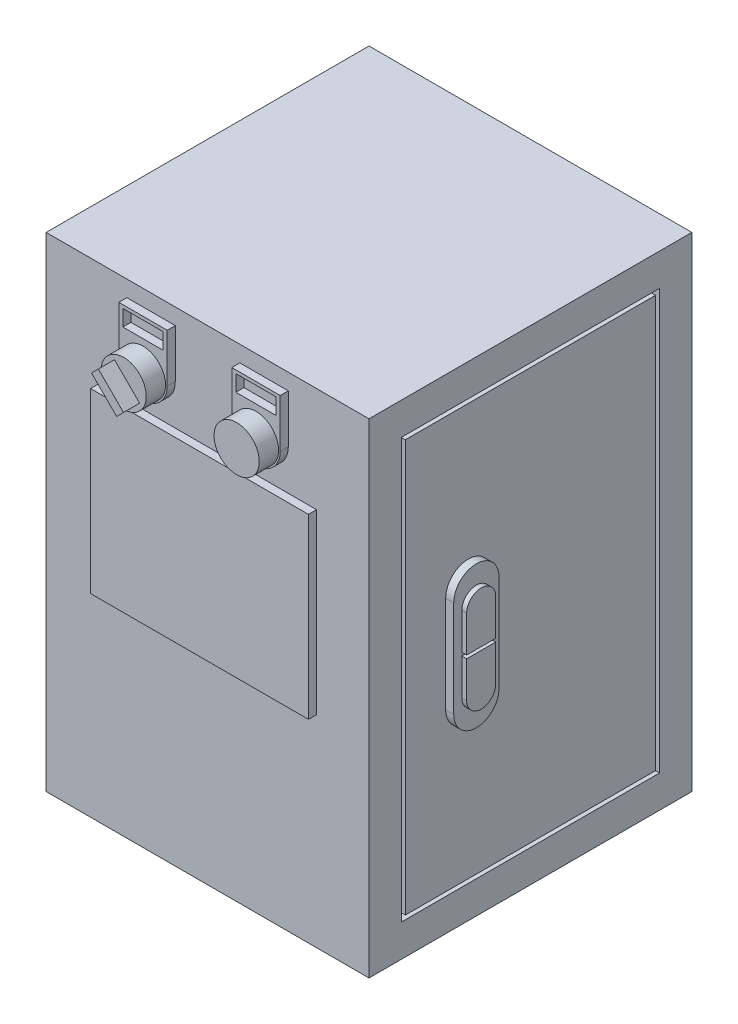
ISO-10303-21;
HEADER;
FILE_DESCRIPTION(('STEP AP214'),'2;1');
FILE_NAME('part.step','',(''),(''),'','','');
FILE_SCHEMA(('AUTOMOTIVE_DESIGN { 1 0 10303 214 1 1 1 1 }'));
ENDSEC;
DATA;
#1=APPLICATION_CONTEXT('core data for automotive mechanical design processes');
#2=APPLICATION_PROTOCOL_DEFINITION('international standard','automotive_design',2000,#1);
#3=PRODUCT_CONTEXT('',#1,'mechanical');
#4=PRODUCT('Part','Part','',(#3));
#5=PRODUCT_RELATED_PRODUCT_CATEGORY('part','',(#4));
#6=PRODUCT_DEFINITION_FORMATION('','',#4);
#7=PRODUCT_DEFINITION_CONTEXT('part definition',#1,'design');
#8=PRODUCT_DEFINITION('design','',#6,#7);
#9=PRODUCT_DEFINITION_SHAPE('','',#8);
#10=(LENGTH_UNIT() NAMED_UNIT(*) SI_UNIT(.MILLI.,.METRE.));
#11=(NAMED_UNIT(*) PLANE_ANGLE_UNIT() SI_UNIT($,.RADIAN.));
#12=(NAMED_UNIT(*) SI_UNIT($,.STERADIAN.) SOLID_ANGLE_UNIT());
#13=UNCERTAINTY_MEASURE_WITH_UNIT(LENGTH_MEASURE(1.E-05),#10,'distance_accuracy_value','');
#14=(GEOMETRIC_REPRESENTATION_CONTEXT(3) GLOBAL_UNCERTAINTY_ASSIGNED_CONTEXT((#13)) GLOBAL_UNIT_ASSIGNED_CONTEXT((#10,
#11,#12)) REPRESENTATION_CONTEXT('',''));
#15=CARTESIAN_POINT('',(0.,0.,0.));
#16=DIRECTION('',(0.,0.,1.));
#17=DIRECTION('',(1.,0.,0.));
#18=AXIS2_PLACEMENT_3D('',#15,#16,#17);
#19=CARTESIAN_POINT('',(108.,126.5,38.5));
#20=DIRECTION('',(1.,0.,0.));
#21=DIRECTION('',(0.,0.,-1.));
#22=AXIS2_PLACEMENT_3D('',#19,#20,#21);
#23=PLANE('',#22);
#24=DIRECTION('',(0.,0.,1.));
#25=VECTOR('',#24,1.);
#26=CARTESIAN_POINT('',(108.,151.,29.5000000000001));
#27=LINE('',#26,#25);
#28=CARTESIAN_POINT('',(108.,151.,29.5000000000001));
#29=VERTEX_POINT('',#28);
#30=CARTESIAN_POINT('',(108.,151.,47.5000000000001));
#31=VERTEX_POINT('',#30);
#32=EDGE_CURVE('E135',#29,#31,#27,.T.);
#33=ORIENTED_EDGE('',*,*,#32,.F.);
#34=DIRECTION('',(0.,1.,0.));
#35=VECTOR('',#34,1.);
#36=CARTESIAN_POINT('',(108.,126.5,29.5));
#37=LINE('',#36,#35);
#38=CARTESIAN_POINT('',(108.,173.5,29.5));
#39=VERTEX_POINT('',#38);
#40=EDGE_CURVE('E146',#29,#39,#37,.T.);
#41=ORIENTED_EDGE('',*,*,#40,.T.);
#42=CARTESIAN_POINT('',(108.,173.5,38.5));
#43=DIRECTION('',(1.,0.,0.));
#44=DIRECTION('',(0.,0.,-1.));
#45=AXIS2_PLACEMENT_3D('',#42,#43,#44);
#46=CIRCLE('',#45,9.);
#47=CARTESIAN_POINT('',(108.,173.5,47.5));
#48=VERTEX_POINT('',#47);
#49=EDGE_CURVE('E148',#39,#48,#46,.T.);
#50=ORIENTED_EDGE('',*,*,#49,.T.);
#51=DIRECTION('',(0.,-1.,0.));
#52=VECTOR('',#51,1.);
#53=CARTESIAN_POINT('',(108.,173.5,47.5));
#54=LINE('',#53,#52);
#55=EDGE_CURVE('E150',#48,#31,#54,.T.);
#56=ORIENTED_EDGE('',*,*,#55,.T.);
#57=EDGE_LOOP('',(#33,#41,#50,#56));
#58=FACE_BOUND('',#57,.T.);
#59=ADVANCED_FACE('F47',(#58),#23,.T.);
#60=CARTESIAN_POINT('',(108.,126.5,38.5));
#61=DIRECTION('',(-1.,0.,0.));
#62=DIRECTION('',(0.,0.,1.));
#63=AXIS2_PLACEMENT_3D('',#60,#61,#62);
#64=CYLINDRICAL_SURFACE('',#63,9.);
#65=CARTESIAN_POINT('',(100.,126.5,38.5));
#66=DIRECTION('',(1.,0.,0.));
#67=DIRECTION('',(0.,0.,-1.));
#68=AXIS2_PLACEMENT_3D('',#65,#66,#67);
#69=CIRCLE('',#68,9.);
#70=CARTESIAN_POINT('',(100.,126.5,47.5));
#71=VERTEX_POINT('',#70);
#72=CARTESIAN_POINT('',(100.,126.5,29.5));
#73=VERTEX_POINT('',#72);
#74=EDGE_CURVE('E154',#71,#73,#69,.T.);
#75=ORIENTED_EDGE('',*,*,#74,.T.);
#76=DIRECTION('',(-1.,0.,0.));
#77=VECTOR('',#76,1.);
#78=CARTESIAN_POINT('',(108.,126.5,29.5));
#79=LINE('',#78,#77);
#80=CARTESIAN_POINT('',(108.,126.5,29.5));
#81=VERTEX_POINT('',#80);
#82=EDGE_CURVE('E12',#81,#73,#79,.T.);
#83=ORIENTED_EDGE('',*,*,#82,.F.);
#84=CARTESIAN_POINT('',(108.,126.5,38.5));
#85=DIRECTION('',(1.,0.,0.));
#86=DIRECTION('',(0.,0.,-1.));
#87=AXIS2_PLACEMENT_3D('',#84,#85,#86);
#88=CIRCLE('',#87,9.);
#89=CARTESIAN_POINT('',(108.,126.5,47.5));
#90=VERTEX_POINT('',#89);
#91=EDGE_CURVE('E144',#90,#81,#88,.T.);
#92=ORIENTED_EDGE('',*,*,#91,.F.);
#93=DIRECTION('',(-1.,0.,0.));
#94=VECTOR('',#93,1.);
#95=CARTESIAN_POINT('',(108.,126.5,47.5));
#96=LINE('',#95,#94);
#97=EDGE_CURVE('E153',#90,#71,#96,.T.);
#98=ORIENTED_EDGE('',*,*,#97,.T.);
#99=EDGE_LOOP('',(#75,#83,#92,#98));
#100=FACE_BOUND('',#99,.T.);
#101=ADVANCED_FACE('F49',(#100),#64,.T.);
#102=CARTESIAN_POINT('',(108.,126.5,29.5));
#103=DIRECTION('',(0.,0.,1.));
#104=DIRECTION('',(1.,0.,0.));
#105=AXIS2_PLACEMENT_3D('',#102,#103,#104);
#106=PLANE('',#105);
#107=ORIENTED_EDGE('',*,*,#40,.F.);
#108=DIRECTION('',(1.,0.,0.));
#109=VECTOR('',#108,1.);
#110=CARTESIAN_POINT('',(105.,151.,29.5000000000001));
#111=LINE('',#110,#109);
#112=CARTESIAN_POINT('',(105.,151.,29.5000000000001));
#113=VERTEX_POINT('',#112);
#114=EDGE_CURVE('E139',#113,#29,#111,.T.);
#115=ORIENTED_EDGE('',*,*,#114,.F.);
#116=DIRECTION('',(0.,1.,0.));
#117=VECTOR('',#116,1.);
#118=CARTESIAN_POINT('',(105.,151.,29.5000000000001));
#119=LINE('',#118,#117);
#120=CARTESIAN_POINT('',(105.,149.,29.5000000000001));
#121=VERTEX_POINT('',#120);
#122=EDGE_CURVE('E126',#121,#113,#119,.T.);
#123=ORIENTED_EDGE('',*,*,#122,.F.);
#124=DIRECTION('',(1.,0.,0.));
#125=VECTOR('',#124,1.);
#126=CARTESIAN_POINT('',(105.,149.,29.5000000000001));
#127=LINE('',#126,#125);
#128=CARTESIAN_POINT('',(108.,149.,29.5000000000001));
#129=VERTEX_POINT('',#128);
#130=EDGE_CURVE('E123',#121,#129,#127,.T.);
#131=ORIENTED_EDGE('',*,*,#130,.T.);
#132=EDGE_CURVE('E99',#81,#129,#37,.T.);
#133=ORIENTED_EDGE('',*,*,#132,.F.);
#134=ORIENTED_EDGE('',*,*,#82,.T.);
#135=DIRECTION('',(0.,1.,0.));
#136=VECTOR('',#135,1.);
#137=CARTESIAN_POINT('',(100.,126.5,29.5));
#138=LINE('',#137,#136);
#139=CARTESIAN_POINT('',(100.,173.5,29.5));
#140=VERTEX_POINT('',#139);
#141=EDGE_CURVE('E157',#73,#140,#138,.T.);
#142=ORIENTED_EDGE('',*,*,#141,.T.);
#143=DIRECTION('',(-1.,0.,0.));
#144=VECTOR('',#143,1.);
#145=CARTESIAN_POINT('',(108.,173.5,29.5));
#146=LINE('',#145,#144);
#147=EDGE_CURVE('E55',#39,#140,#146,.T.);
#148=ORIENTED_EDGE('',*,*,#147,.F.);
#149=EDGE_LOOP('',(#107,#115,#123,#131,#133,#134,#142,#148));
#150=FACE_BOUND('',#149,.T.);
#151=ADVANCED_FACE('F191',(#150),#106,.F.);
#152=CARTESIAN_POINT('',(108.,173.5,38.5));
#153=DIRECTION('',(-1.,0.,0.));
#154=DIRECTION('',(0.,0.,1.));
#155=AXIS2_PLACEMENT_3D('',#152,#153,#154);
#156=CYLINDRICAL_SURFACE('',#155,9.);
#157=CARTESIAN_POINT('',(100.,173.5,38.5));
#158=DIRECTION('',(1.,0.,0.));
#159=DIRECTION('',(0.,0.,-1.));
#160=AXIS2_PLACEMENT_3D('',#157,#158,#159);
#161=CIRCLE('',#160,9.);
#162=CARTESIAN_POINT('',(100.,173.5,47.5));
#163=VERTEX_POINT('',#162);
#164=EDGE_CURVE('E160',#140,#163,#161,.T.);
#165=ORIENTED_EDGE('',*,*,#164,.T.);
#166=DIRECTION('',(-1.,0.,0.));
#167=VECTOR('',#166,1.);
#168=CARTESIAN_POINT('',(108.,173.5,47.5));
#169=LINE('',#168,#167);
#170=EDGE_CURVE('E164',#48,#163,#169,.T.);
#171=ORIENTED_EDGE('',*,*,#170,.F.);
#172=ORIENTED_EDGE('',*,*,#49,.F.);
#173=ORIENTED_EDGE('',*,*,#147,.T.);
#174=EDGE_LOOP('',(#165,#171,#172,#173));
#175=FACE_BOUND('',#174,.T.);
#176=ADVANCED_FACE('F170',(#175),#156,.T.);
#177=CARTESIAN_POINT('',(108.,173.5,47.5));
#178=DIRECTION('',(0.,0.,-1.));
#179=DIRECTION('',(-1.,0.,0.));
#180=AXIS2_PLACEMENT_3D('',#177,#178,#179);
#181=PLANE('',#180);
#182=DIRECTION('',(0.,-1.,0.));
#183=VECTOR('',#182,1.);
#184=CARTESIAN_POINT('',(105.,151.,47.5000000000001));
#185=LINE('',#184,#183);
#186=CARTESIAN_POINT('',(105.,151.,47.5000000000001));
#187=VERTEX_POINT('',#186);
#188=CARTESIAN_POINT('',(105.,149.,47.5000000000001));
#189=VERTEX_POINT('',#188);
#190=EDGE_CURVE('E127',#187,#189,#185,.T.);
#191=ORIENTED_EDGE('',*,*,#190,.F.);
#192=DIRECTION('',(1.,0.,0.));
#193=VECTOR('',#192,1.);
#194=CARTESIAN_POINT('',(105.,151.,47.5000000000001));
#195=LINE('',#194,#193);
#196=EDGE_CURVE('E158',#187,#31,#195,.T.);
#197=ORIENTED_EDGE('',*,*,#196,.T.);
#198=ORIENTED_EDGE('',*,*,#55,.F.);
#199=ORIENTED_EDGE('',*,*,#170,.T.);
#200=DIRECTION('',(0.,-1.,0.));
#201=VECTOR('',#200,1.);
#202=CARTESIAN_POINT('',(100.,173.5,47.5));
#203=LINE('',#202,#201);
#204=EDGE_CURVE('E92',#163,#71,#203,.T.);
#205=ORIENTED_EDGE('',*,*,#204,.T.);
#206=ORIENTED_EDGE('',*,*,#97,.F.);
#207=CARTESIAN_POINT('',(108.,149.,47.5));
#208=VERTEX_POINT('',#207);
#209=EDGE_CURVE('E70',#208,#90,#54,.T.);
#210=ORIENTED_EDGE('',*,*,#209,.F.);
#211=DIRECTION('',(1.,0.,0.));
#212=VECTOR('',#211,1.);
#213=CARTESIAN_POINT('',(105.,149.,47.5000000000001));
#214=LINE('',#213,#212);
#215=EDGE_CURVE('E62',#189,#208,#214,.T.);
#216=ORIENTED_EDGE('',*,*,#215,.F.);
#217=EDGE_LOOP('',(#191,#197,#198,#199,#205,#206,#210,#216));
#218=FACE_BOUND('',#217,.T.);
#219=ADVANCED_FACE('F137',(#218),#181,.F.);
#220=DIRECTION('',(0.,0.,-1.));
#221=VECTOR('',#220,1.);
#222=CARTESIAN_POINT('',(108.,149.,29.5000000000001));
#223=LINE('',#222,#221);
#224=EDGE_CURVE('E180',#208,#129,#223,.T.);
#225=ORIENTED_EDGE('',*,*,#224,.F.);
#226=ORIENTED_EDGE('',*,*,#209,.T.);
#227=ORIENTED_EDGE('',*,*,#91,.T.);
#228=ORIENTED_EDGE('',*,*,#132,.T.);
#229=EDGE_LOOP('',(#225,#226,#227,#228));
#230=FACE_BOUND('',#229,.T.);
#231=ADVANCED_FACE('F179',(#230),#23,.T.);
#232=CARTESIAN_POINT('',(100.,126.5,38.5));
#233=DIRECTION('',(1.,0.,0.));
#234=DIRECTION('',(0.,0.,-1.));
#235=AXIS2_PLACEMENT_3D('',#232,#233,#234);
#236=PLANE('',#235);
#237=ORIENTED_EDGE('',*,*,#74,.F.);
#238=ORIENTED_EDGE('',*,*,#204,.F.);
#239=ORIENTED_EDGE('',*,*,#164,.F.);
#240=ORIENTED_EDGE('',*,*,#141,.F.);
#241=EDGE_LOOP('',(#237,#238,#239,#240));
#242=FACE_BOUND('',#241,.T.);
#243=ADVANCED_FACE('F175',(#242),#236,.F.);
#244=CARTESIAN_POINT('',(105.,151.,29.5000000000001));
#245=DIRECTION('',(0.,1.,0.));
#246=DIRECTION('',(0.,0.,1.));
#247=AXIS2_PLACEMENT_3D('',#244,#245,#246);
#248=PLANE('',#247);
#249=ORIENTED_EDGE('',*,*,#32,.T.);
#250=ORIENTED_EDGE('',*,*,#196,.F.);
#251=DIRECTION('',(0.,0.,1.));
#252=VECTOR('',#251,1.);
#253=CARTESIAN_POINT('',(105.,151.,29.5000000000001));
#254=LINE('',#253,#252);
#255=EDGE_CURVE('E133',#113,#187,#254,.T.);
#256=ORIENTED_EDGE('',*,*,#255,.F.);
#257=ORIENTED_EDGE('',*,*,#114,.T.);
#258=EDGE_LOOP('',(#249,#250,#256,#257));
#259=FACE_BOUND('',#258,.T.);
#260=ADVANCED_FACE('F188',(#259),#248,.F.);
#261=CARTESIAN_POINT('',(105.,149.,29.5000000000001));
#262=DIRECTION('',(0.,-1.,0.));
#263=DIRECTION('',(0.,0.,-1.));
#264=AXIS2_PLACEMENT_3D('',#261,#262,#263);
#265=PLANE('',#264);
#266=ORIENTED_EDGE('',*,*,#224,.T.);
#267=ORIENTED_EDGE('',*,*,#130,.F.);
#268=DIRECTION('',(0.,0.,-1.));
#269=VECTOR('',#268,1.);
#270=CARTESIAN_POINT('',(105.,149.,29.5000000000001));
#271=LINE('',#270,#269);
#272=EDGE_CURVE('E120',#189,#121,#271,.T.);
#273=ORIENTED_EDGE('',*,*,#272,.F.);
#274=ORIENTED_EDGE('',*,*,#215,.T.);
#275=EDGE_LOOP('',(#266,#267,#273,#274));
#276=FACE_BOUND('',#275,.T.);
#277=ADVANCED_FACE('F122',(#276),#265,.F.);
#278=CARTESIAN_POINT('',(105.,0.,0.));
#279=DIRECTION('',(-1.,0.,0.));
#280=DIRECTION('',(0.,0.,1.));
#281=AXIS2_PLACEMENT_3D('',#278,#279,#280);
#282=PLANE('',#281);
#283=ORIENTED_EDGE('',*,*,#190,.T.);
#284=ORIENTED_EDGE('',*,*,#272,.T.);
#285=ORIENTED_EDGE('',*,*,#122,.T.);
#286=ORIENTED_EDGE('',*,*,#255,.T.);
#287=EDGE_LOOP('',(#283,#284,#285,#286));
#288=FACE_BOUND('',#287,.T.);
#289=ADVANCED_FACE('F131',(#288),#282,.F.);
#290=CLOSED_SHELL('',(#59,#101,#151,#176,#219,#231,#243,#260,#277,#289));
#291=MANIFOLD_SOLID_BREP('B2',#290);
#292=CARTESIAN_POINT('',(105.,120.,38.5));
#293=DIRECTION('',(-1.,0.,0.));
#294=DIRECTION('',(0.,0.,1.));
#295=AXIS2_PLACEMENT_3D('',#292,#293,#294);
#296=PLANE('',#295);
#297=CARTESIAN_POINT('',(105.,120.,38.5));
#298=DIRECTION('',(1.,0.,0.));
#299=DIRECTION('',(0.,0.,1.));
#300=AXIS2_PLACEMENT_3D('',#297,#298,#299);
#301=CIRCLE('',#300,14.);
#302=CARTESIAN_POINT('',(105.,120.,52.5));
#303=VERTEX_POINT('',#302);
#304=CARTESIAN_POINT('',(105.,120.,24.5));
#305=VERTEX_POINT('',#304);
#306=EDGE_CURVE('E382',#303,#305,#301,.T.);
#307=ORIENTED_EDGE('',*,*,#306,.T.);
#308=DIRECTION('',(0.,1.,0.));
#309=VECTOR('',#308,1.);
#310=CARTESIAN_POINT('',(105.,120.,24.5));
#311=LINE('',#310,#309);
#312=CARTESIAN_POINT('',(105.,180.,24.5));
#313=VERTEX_POINT('',#312);
#314=EDGE_CURVE('E385',#305,#313,#311,.T.);
#315=ORIENTED_EDGE('',*,*,#314,.T.);
#316=CARTESIAN_POINT('',(105.,180.,38.5));
#317=DIRECTION('',(1.,0.,0.));
#318=DIRECTION('',(0.,0.,-1.));
#319=AXIS2_PLACEMENT_3D('',#316,#317,#318);
#320=CIRCLE('',#319,14.);
#321=CARTESIAN_POINT('',(105.,180.,52.5));
#322=VERTEX_POINT('',#321);
#323=EDGE_CURVE('E388',#313,#322,#320,.T.);
#324=ORIENTED_EDGE('',*,*,#323,.T.);
#325=DIRECTION('',(0.,-1.,0.));
#326=VECTOR('',#325,1.);
#327=CARTESIAN_POINT('',(105.,180.,52.5));
#328=LINE('',#327,#326);
#329=EDGE_CURVE('E390',#322,#303,#328,.T.);
#330=ORIENTED_EDGE('',*,*,#329,.T.);
#331=EDGE_LOOP('',(#307,#315,#324,#330));
#332=FACE_BOUND('',#331,.T.);
#333=CARTESIAN_POINT('',(105.,126.5,38.5));
#334=DIRECTION('',(1.,0.,0.));
#335=DIRECTION('',(0.,0.,1.));
#336=AXIS2_PLACEMENT_3D('',#333,#334,#335);
#337=CIRCLE('',#336,9.);
#338=CARTESIAN_POINT('',(105.,126.5,47.5));
#339=VERTEX_POINT('',#338);
#340=CARTESIAN_POINT('',(105.,126.5,29.5));
#341=VERTEX_POINT('',#340);
#342=EDGE_CURVE('E346',#339,#341,#337,.T.);
#343=ORIENTED_EDGE('',*,*,#342,.F.);
#344=DIRECTION('',(0.,-1.,0.));
#345=VECTOR('',#344,1.);
#346=CARTESIAN_POINT('',(105.,126.5,47.5));
#347=LINE('',#346,#345);
#348=CARTESIAN_POINT('',(105.,173.5,47.5));
#349=VERTEX_POINT('',#348);
#350=EDGE_CURVE('E368',#349,#339,#347,.T.);
#351=ORIENTED_EDGE('',*,*,#350,.F.);
#352=CARTESIAN_POINT('',(105.,173.5,38.5));
#353=DIRECTION('',(1.,0.,0.));
#354=DIRECTION('',(0.,0.,-1.));
#355=AXIS2_PLACEMENT_3D('',#352,#353,#354);
#356=CIRCLE('',#355,9.);
#357=CARTESIAN_POINT('',(105.,173.5,29.5));
#358=VERTEX_POINT('',#357);
#359=EDGE_CURVE('E366',#358,#349,#356,.T.);
#360=ORIENTED_EDGE('',*,*,#359,.F.);
#361=DIRECTION('',(0.,1.,0.));
#362=VECTOR('',#361,1.);
#363=CARTESIAN_POINT('',(105.,173.5,29.5));
#364=LINE('',#363,#362);
#365=EDGE_CURVE('E354',#341,#358,#364,.T.);
#366=ORIENTED_EDGE('',*,*,#365,.F.);
#367=EDGE_LOOP('',(#343,#351,#360,#366));
#368=FACE_BOUND('',#367,.T.);
#369=ADVANCED_FACE('F281',(#332,#368),#296,.F.);
#370=CARTESIAN_POINT('',(100.,120.,38.5));
#371=DIRECTION('',(-1.,0.,0.));
#372=DIRECTION('',(0.,0.,1.));
#373=AXIS2_PLACEMENT_3D('',#370,#371,#372);
#374=PLANE('',#373);
#375=CARTESIAN_POINT('',(100.,120.,38.5));
#376=DIRECTION('',(1.,0.,0.));
#377=DIRECTION('',(0.,0.,1.));
#378=AXIS2_PLACEMENT_3D('',#375,#376,#377);
#379=CIRCLE('',#378,14.);
#380=CARTESIAN_POINT('',(100.,120.,52.5));
#381=VERTEX_POINT('',#380);
#382=CARTESIAN_POINT('',(100.,120.,24.5));
#383=VERTEX_POINT('',#382);
#384=EDGE_CURVE('E362',#381,#383,#379,.T.);
#385=ORIENTED_EDGE('',*,*,#384,.F.);
#386=DIRECTION('',(0.,-1.,0.));
#387=VECTOR('',#386,1.);
#388=CARTESIAN_POINT('',(100.,180.,52.5));
#389=LINE('',#388,#387);
#390=CARTESIAN_POINT('',(100.,180.,52.5));
#391=VERTEX_POINT('',#390);
#392=EDGE_CURVE('E386',#391,#381,#389,.T.);
#393=ORIENTED_EDGE('',*,*,#392,.F.);
#394=CARTESIAN_POINT('',(100.,180.,38.5));
#395=DIRECTION('',(1.,0.,0.));
#396=DIRECTION('',(0.,0.,-1.));
#397=AXIS2_PLACEMENT_3D('',#394,#395,#396);
#398=CIRCLE('',#397,14.);
#399=CARTESIAN_POINT('',(100.,180.,24.5));
#400=VERTEX_POINT('',#399);
#401=EDGE_CURVE('E397',#400,#391,#398,.T.);
#402=ORIENTED_EDGE('',*,*,#401,.F.);
#403=DIRECTION('',(0.,1.,0.));
#404=VECTOR('',#403,1.);
#405=CARTESIAN_POINT('',(100.,120.,24.5));
#406=LINE('',#405,#404);
#407=EDGE_CURVE('E395',#383,#400,#406,.T.);
#408=ORIENTED_EDGE('',*,*,#407,.F.);
#409=EDGE_LOOP('',(#385,#393,#402,#408));
#410=FACE_BOUND('',#409,.T.);
#411=DIRECTION('',(0.,-1.,0.));
#412=VECTOR('',#411,1.);
#413=CARTESIAN_POINT('',(100.,126.5,47.5));
#414=LINE('',#413,#412);
#415=CARTESIAN_POINT('',(100.,173.5,47.5));
#416=VERTEX_POINT('',#415);
#417=CARTESIAN_POINT('',(100.,126.5,47.5));
#418=VERTEX_POINT('',#417);
#419=EDGE_CURVE('E355',#416,#418,#414,.T.);
#420=ORIENTED_EDGE('',*,*,#419,.T.);
#421=CARTESIAN_POINT('',(100.,126.5,38.5));
#422=DIRECTION('',(1.,0.,0.));
#423=DIRECTION('',(0.,0.,1.));
#424=AXIS2_PLACEMENT_3D('',#421,#422,#423);
#425=CIRCLE('',#424,9.);
#426=CARTESIAN_POINT('',(100.,126.5,29.5));
#427=VERTEX_POINT('',#426);
#428=EDGE_CURVE('E304',#418,#427,#425,.T.);
#429=ORIENTED_EDGE('',*,*,#428,.T.);
#430=DIRECTION('',(0.,1.,0.));
#431=VECTOR('',#430,1.);
#432=CARTESIAN_POINT('',(100.,173.5,29.5));
#433=LINE('',#432,#431);
#434=CARTESIAN_POINT('',(100.,173.5,29.5));
#435=VERTEX_POINT('',#434);
#436=EDGE_CURVE('E361',#427,#435,#433,.T.);
#437=ORIENTED_EDGE('',*,*,#436,.T.);
#438=CARTESIAN_POINT('',(100.,173.5,38.5));
#439=DIRECTION('',(1.,0.,0.));
#440=DIRECTION('',(0.,0.,-1.));
#441=AXIS2_PLACEMENT_3D('',#438,#439,#440);
#442=CIRCLE('',#441,9.);
#443=EDGE_CURVE('E374',#435,#416,#442,.T.);
#444=ORIENTED_EDGE('',*,*,#443,.T.);
#445=EDGE_LOOP('',(#420,#429,#437,#444));
#446=FACE_BOUND('',#445,.T.);
#447=ADVANCED_FACE('F415',(#410,#446),#374,.T.);
#448=CARTESIAN_POINT('',(105.,120.,38.5));
#449=DIRECTION('',(-1.,0.,0.));
#450=DIRECTION('',(0.,0.,1.));
#451=AXIS2_PLACEMENT_3D('',#448,#449,#450);
#452=CYLINDRICAL_SURFACE('',#451,14.);
#453=ORIENTED_EDGE('',*,*,#384,.T.);
#454=DIRECTION('',(-1.,0.,0.));
#455=VECTOR('',#454,1.);
#456=CARTESIAN_POINT('',(105.,120.,24.5));
#457=LINE('',#456,#455);
#458=EDGE_CURVE('E45',#305,#383,#457,.T.);
#459=ORIENTED_EDGE('',*,*,#458,.F.);
#460=ORIENTED_EDGE('',*,*,#306,.F.);
#461=DIRECTION('',(-1.,0.,0.));
#462=VECTOR('',#461,1.);
#463=CARTESIAN_POINT('',(105.,120.,52.5));
#464=LINE('',#463,#462);
#465=EDGE_CURVE('E392',#303,#381,#464,.T.);
#466=ORIENTED_EDGE('',*,*,#465,.T.);
#467=EDGE_LOOP('',(#453,#459,#460,#466));
#468=FACE_BOUND('',#467,.T.);
#469=ADVANCED_FACE('F283',(#468),#452,.T.);
#470=CARTESIAN_POINT('',(105.,120.,24.5));
#471=DIRECTION('',(0.,0.,1.));
#472=DIRECTION('',(1.,0.,0.));
#473=AXIS2_PLACEMENT_3D('',#470,#471,#472);
#474=PLANE('',#473);
#475=ORIENTED_EDGE('',*,*,#407,.T.);
#476=DIRECTION('',(-1.,0.,0.));
#477=VECTOR('',#476,1.);
#478=CARTESIAN_POINT('',(105.,180.,24.5));
#479=LINE('',#478,#477);
#480=EDGE_CURVE('E289',#313,#400,#479,.T.);
#481=ORIENTED_EDGE('',*,*,#480,.F.);
#482=ORIENTED_EDGE('',*,*,#314,.F.);
#483=ORIENTED_EDGE('',*,*,#458,.T.);
#484=EDGE_LOOP('',(#475,#481,#482,#483));
#485=FACE_BOUND('',#484,.T.);
#486=ADVANCED_FACE('F425',(#485),#474,.F.);
#487=CARTESIAN_POINT('',(105.,180.,38.5));
#488=DIRECTION('',(-1.,0.,0.));
#489=DIRECTION('',(0.,0.,1.));
#490=AXIS2_PLACEMENT_3D('',#487,#488,#489);
#491=CYLINDRICAL_SURFACE('',#490,14.);
#492=ORIENTED_EDGE('',*,*,#401,.T.);
#493=DIRECTION('',(-1.,0.,0.));
#494=VECTOR('',#493,1.);
#495=CARTESIAN_POINT('',(105.,180.,52.5));
#496=LINE('',#495,#494);
#497=EDGE_CURVE('E402',#322,#391,#496,.T.);
#498=ORIENTED_EDGE('',*,*,#497,.F.);
#499=ORIENTED_EDGE('',*,*,#323,.F.);
#500=ORIENTED_EDGE('',*,*,#480,.T.);
#501=EDGE_LOOP('',(#492,#498,#499,#500));
#502=FACE_BOUND('',#501,.T.);
#503=ADVANCED_FACE('F409',(#502),#491,.T.);
#504=CARTESIAN_POINT('',(105.,180.,52.5));
#505=DIRECTION('',(0.,0.,-1.));
#506=DIRECTION('',(-1.,0.,0.));
#507=AXIS2_PLACEMENT_3D('',#504,#505,#506);
#508=PLANE('',#507);
#509=ORIENTED_EDGE('',*,*,#392,.T.);
#510=ORIENTED_EDGE('',*,*,#465,.F.);
#511=ORIENTED_EDGE('',*,*,#329,.F.);
#512=ORIENTED_EDGE('',*,*,#497,.T.);
#513=EDGE_LOOP('',(#509,#510,#511,#512));
#514=FACE_BOUND('',#513,.T.);
#515=ADVANCED_FACE('F419',(#514),#508,.F.);
#516=CARTESIAN_POINT('',(105.,126.5,38.5));
#517=DIRECTION('',(-1.,0.,0.));
#518=DIRECTION('',(0.,0.,1.));
#519=AXIS2_PLACEMENT_3D('',#516,#517,#518);
#520=CYLINDRICAL_SURFACE('',#519,9.);
#521=ORIENTED_EDGE('',*,*,#428,.F.);
#522=DIRECTION('',(-1.,0.,0.));
#523=VECTOR('',#522,1.);
#524=CARTESIAN_POINT('',(105.,126.5,47.5));
#525=LINE('',#524,#523);
#526=EDGE_CURVE('E350',#339,#418,#525,.T.);
#527=ORIENTED_EDGE('',*,*,#526,.F.);
#528=ORIENTED_EDGE('',*,*,#342,.T.);
#529=DIRECTION('',(-1.,0.,0.));
#530=VECTOR('',#529,1.);
#531=CARTESIAN_POINT('',(105.,126.5,29.5));
#532=LINE('',#531,#530);
#533=EDGE_CURVE('E349',#341,#427,#532,.T.);
#534=ORIENTED_EDGE('',*,*,#533,.T.);
#535=EDGE_LOOP('',(#521,#527,#528,#534));
#536=FACE_BOUND('',#535,.T.);
#537=ADVANCED_FACE('F348',(#536),#520,.F.);
#538=CARTESIAN_POINT('',(105.,173.5,29.5));
#539=DIRECTION('',(0.,0.,1.));
#540=DIRECTION('',(1.,0.,0.));
#541=AXIS2_PLACEMENT_3D('',#538,#539,#540);
#542=PLANE('',#541);
#543=ORIENTED_EDGE('',*,*,#436,.F.);
#544=ORIENTED_EDGE('',*,*,#533,.F.);
#545=ORIENTED_EDGE('',*,*,#365,.T.);
#546=DIRECTION('',(-1.,0.,0.));
#547=VECTOR('',#546,1.);
#548=CARTESIAN_POINT('',(105.,173.5,29.5));
#549=LINE('',#548,#547);
#550=EDGE_CURVE('E363',#358,#435,#549,.T.);
#551=ORIENTED_EDGE('',*,*,#550,.T.);
#552=EDGE_LOOP('',(#543,#544,#545,#551));
#553=FACE_BOUND('',#552,.T.);
#554=ADVANCED_FACE('F358',(#553),#542,.T.);
#555=CARTESIAN_POINT('',(105.,173.5,38.5));
#556=DIRECTION('',(-1.,0.,0.));
#557=DIRECTION('',(0.,0.,1.));
#558=AXIS2_PLACEMENT_3D('',#555,#556,#557);
#559=CYLINDRICAL_SURFACE('',#558,9.);
#560=ORIENTED_EDGE('',*,*,#443,.F.);
#561=ORIENTED_EDGE('',*,*,#550,.F.);
#562=ORIENTED_EDGE('',*,*,#359,.T.);
#563=DIRECTION('',(-1.,0.,0.));
#564=VECTOR('',#563,1.);
#565=CARTESIAN_POINT('',(105.,173.5,47.5));
#566=LINE('',#565,#564);
#567=EDGE_CURVE('E296',#349,#416,#566,.T.);
#568=ORIENTED_EDGE('',*,*,#567,.T.);
#569=EDGE_LOOP('',(#560,#561,#562,#568));
#570=FACE_BOUND('',#569,.T.);
#571=ADVANCED_FACE('F448',(#570),#559,.F.);
#572=CARTESIAN_POINT('',(105.,126.5,47.5));
#573=DIRECTION('',(0.,0.,-1.));
#574=DIRECTION('',(-1.,0.,0.));
#575=AXIS2_PLACEMENT_3D('',#572,#573,#574);
#576=PLANE('',#575);
#577=ORIENTED_EDGE('',*,*,#419,.F.);
#578=ORIENTED_EDGE('',*,*,#567,.F.);
#579=ORIENTED_EDGE('',*,*,#350,.T.);
#580=ORIENTED_EDGE('',*,*,#526,.T.);
#581=EDGE_LOOP('',(#577,#578,#579,#580));
#582=FACE_BOUND('',#581,.T.);
#583=ADVANCED_FACE('F452',(#582),#576,.T.);
#584=CLOSED_SHELL('',(#369,#447,#469,#486,#503,#515,#537,#554,#571,#583));
#585=MANIFOLD_SOLID_BREP('B6',#584);
#586=CARTESIAN_POINT('',(-67.5,235.,105.));
#587=DIRECTION('',(1.,0.,0.));
#588=DIRECTION('',(0.,0.,-1.));
#589=AXIS2_PLACEMENT_3D('',#586,#587,#588);
#590=PLANE('',#589);
#591=DIRECTION('',(0.,-1.,0.));
#592=VECTOR('',#591,1.);
#593=CARTESIAN_POINT('',(-67.5,235.,100.));
#594=LINE('',#593,#592);
#595=CARTESIAN_POINT('',(-67.5,235.,100.));
#596=VERTEX_POINT('',#595);
#597=CARTESIAN_POINT('',(-67.5,125.,100.));
#598=VERTEX_POINT('',#597);
#599=EDGE_CURVE('E583',#596,#598,#594,.T.);
#600=ORIENTED_EDGE('',*,*,#599,.T.);
#601=DIRECTION('',(0.,0.,-1.));
#602=VECTOR('',#601,1.);
#603=CARTESIAN_POINT('',(-67.5,125.,105.));
#604=LINE('',#603,#602);
#605=CARTESIAN_POINT('',(-67.5,125.,105.));
#606=VERTEX_POINT('',#605);
#607=EDGE_CURVE('E279',#606,#598,#604,.T.);
#608=ORIENTED_EDGE('',*,*,#607,.F.);
#609=DIRECTION('',(0.,-1.,0.));
#610=VECTOR('',#609,1.);
#611=CARTESIAN_POINT('',(-67.5,235.,105.));
#612=LINE('',#611,#610);
#613=CARTESIAN_POINT('',(-67.5,235.,105.));
#614=VERTEX_POINT('',#613);
#615=EDGE_CURVE('E571',#614,#606,#612,.T.);
#616=ORIENTED_EDGE('',*,*,#615,.F.);
#617=DIRECTION('',(0.,0.,-1.));
#618=VECTOR('',#617,1.);
#619=CARTESIAN_POINT('',(-67.5,235.,105.));
#620=LINE('',#619,#618);
#621=EDGE_CURVE('E579',#614,#596,#620,.T.);
#622=ORIENTED_EDGE('',*,*,#621,.T.);
#623=EDGE_LOOP('',(#600,#608,#616,#622));
#624=FACE_BOUND('',#623,.T.);
#625=ADVANCED_FACE('F520',(#624),#590,.F.);
#626=CARTESIAN_POINT('',(67.5,125.,105.));
#627=DIRECTION('',(0.,1.,0.));
#628=DIRECTION('',(-1.,0.,0.));
#629=AXIS2_PLACEMENT_3D('',#626,#627,#628);
#630=PLANE('',#629);
#631=DIRECTION('',(1.,0.,0.));
#632=VECTOR('',#631,1.);
#633=CARTESIAN_POINT('',(67.5,125.,100.));
#634=LINE('',#633,#632);
#635=CARTESIAN_POINT('',(67.5,125.,100.));
#636=VERTEX_POINT('',#635);
#637=EDGE_CURVE('E575',#598,#636,#634,.T.);
#638=ORIENTED_EDGE('',*,*,#637,.T.);
#639=DIRECTION('',(0.,0.,-1.));
#640=VECTOR('',#639,1.);
#641=CARTESIAN_POINT('',(67.5,125.,105.));
#642=LINE('',#641,#640);
#643=CARTESIAN_POINT('',(67.5,125.,105.));
#644=VERTEX_POINT('',#643);
#645=EDGE_CURVE('E528',#644,#636,#642,.T.);
#646=ORIENTED_EDGE('',*,*,#645,.F.);
#647=DIRECTION('',(1.,0.,0.));
#648=VECTOR('',#647,1.);
#649=CARTESIAN_POINT('',(67.5,125.,105.));
#650=LINE('',#649,#648);
#651=EDGE_CURVE('E566',#606,#644,#650,.T.);
#652=ORIENTED_EDGE('',*,*,#651,.F.);
#653=ORIENTED_EDGE('',*,*,#607,.T.);
#654=EDGE_LOOP('',(#638,#646,#652,#653));
#655=FACE_BOUND('',#654,.T.);
#656=ADVANCED_FACE('F574',(#655),#630,.F.);
#657=CARTESIAN_POINT('',(67.5,235.,105.));
#658=DIRECTION('',(-1.,0.,0.));
#659=DIRECTION('',(0.,-1.,0.));
#660=AXIS2_PLACEMENT_3D('',#657,#658,#659);
#661=PLANE('',#660);
#662=DIRECTION('',(0.,1.,0.));
#663=VECTOR('',#662,1.);
#664=CARTESIAN_POINT('',(67.5,235.,100.));
#665=LINE('',#664,#663);
#666=CARTESIAN_POINT('',(67.5,235.,100.));
#667=VERTEX_POINT('',#666);
#668=EDGE_CURVE('E553',#636,#667,#665,.T.);
#669=ORIENTED_EDGE('',*,*,#668,.T.);
#670=DIRECTION('',(0.,0.,-1.));
#671=VECTOR('',#670,1.);
#672=CARTESIAN_POINT('',(67.5,235.,105.));
#673=LINE('',#672,#671);
#674=CARTESIAN_POINT('',(67.5,235.,105.));
#675=VERTEX_POINT('',#674);
#676=EDGE_CURVE('E576',#675,#667,#673,.T.);
#677=ORIENTED_EDGE('',*,*,#676,.F.);
#678=DIRECTION('',(0.,1.,0.));
#679=VECTOR('',#678,1.);
#680=CARTESIAN_POINT('',(67.5,235.,105.));
#681=LINE('',#680,#679);
#682=EDGE_CURVE('E569',#644,#675,#681,.T.);
#683=ORIENTED_EDGE('',*,*,#682,.F.);
#684=ORIENTED_EDGE('',*,*,#645,.T.);
#685=EDGE_LOOP('',(#669,#677,#683,#684));
#686=FACE_BOUND('',#685,.T.);
#687=ADVANCED_FACE('F577',(#686),#661,.F.);
#688=CARTESIAN_POINT('',(67.5,235.,105.));
#689=DIRECTION('',(0.,-1.,0.));
#690=DIRECTION('',(1.,0.,0.));
#691=AXIS2_PLACEMENT_3D('',#688,#689,#690);
#692=PLANE('',#691);
#693=DIRECTION('',(-1.,0.,0.));
#694=VECTOR('',#693,1.);
#695=CARTESIAN_POINT('',(67.5,235.,100.));
#696=LINE('',#695,#694);
#697=EDGE_CURVE('E559',#667,#596,#696,.T.);
#698=ORIENTED_EDGE('',*,*,#697,.T.);
#699=ORIENTED_EDGE('',*,*,#621,.F.);
#700=DIRECTION('',(-1.,0.,0.));
#701=VECTOR('',#700,1.);
#702=CARTESIAN_POINT('',(67.5,235.,105.));
#703=LINE('',#702,#701);
#704=EDGE_CURVE('E536',#675,#614,#703,.T.);
#705=ORIENTED_EDGE('',*,*,#704,.F.);
#706=ORIENTED_EDGE('',*,*,#676,.T.);
#707=EDGE_LOOP('',(#698,#699,#705,#706));
#708=FACE_BOUND('',#707,.T.);
#709=ADVANCED_FACE('F590',(#708),#692,.F.);
#710=CARTESIAN_POINT('',(0.,0.,105.));
#711=DIRECTION('',(0.,0.,-1.));
#712=DIRECTION('',(-1.,0.,0.));
#713=AXIS2_PLACEMENT_3D('',#710,#711,#712);
#714=PLANE('',#713);
#715=ORIENTED_EDGE('',*,*,#615,.T.);
#716=ORIENTED_EDGE('',*,*,#651,.T.);
#717=ORIENTED_EDGE('',*,*,#682,.T.);
#718=ORIENTED_EDGE('',*,*,#704,.T.);
#719=EDGE_LOOP('',(#715,#716,#717,#718));
#720=FACE_BOUND('',#719,.T.);
#721=ADVANCED_FACE('F567',(#720),#714,.F.);
#722=CARTESIAN_POINT('',(0.,0.,100.));
#723=DIRECTION('',(0.,0.,-1.));
#724=DIRECTION('',(-1.,0.,0.));
#725=AXIS2_PLACEMENT_3D('',#722,#723,#724);
#726=PLANE('',#725);
#727=ORIENTED_EDGE('',*,*,#599,.F.);
#728=ORIENTED_EDGE('',*,*,#697,.F.);
#729=ORIENTED_EDGE('',*,*,#668,.F.);
#730=ORIENTED_EDGE('',*,*,#637,.F.);
#731=EDGE_LOOP('',(#727,#728,#729,#730));
#732=FACE_BOUND('',#731,.T.);
#733=ADVANCED_FACE('F593',(#732),#726,.T.);
#734=CLOSED_SHELL('',(#625,#656,#687,#709,#721,#733));
#735=MANIFOLD_SOLID_BREP('B39',#734);
#736=CARTESIAN_POINT('',(-44.8994949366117,265.656854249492,127.));
#737=DIRECTION('',(0.707106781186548,0.707106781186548,0.));
#738=DIRECTION('',(-0.707106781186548,0.707106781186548,0.));
#739=AXIS2_PLACEMENT_3D('',#736,#737,#738);
#740=PLANE('',#739);
#741=DIRECTION('',(0.707106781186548,-0.707106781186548,0.));
#742=VECTOR('',#741,1.);
#743=CARTESIAN_POINT('',(-44.8994949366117,265.656854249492,117.));
#744=LINE('',#743,#742);
#745=CARTESIAN_POINT('',(-44.8994949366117,265.656854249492,117.));
#746=VERTEX_POINT('',#745);
#747=CARTESIAN_POINT('',(-29.3431457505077,250.100505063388,117.));
#748=VERTEX_POINT('',#747);
#749=EDGE_CURVE('E705',#746,#748,#744,.T.);
#750=ORIENTED_EDGE('',*,*,#749,.T.);
#751=DIRECTION('',(0.,0.,-1.));
#752=VECTOR('',#751,1.);
#753=CARTESIAN_POINT('',(-29.3431457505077,250.100505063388,127.));
#754=LINE('',#753,#752);
#755=CARTESIAN_POINT('',(-29.3431457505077,250.100505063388,127.));
#756=VERTEX_POINT('',#755);
#757=EDGE_CURVE('E659',#756,#748,#754,.T.);
#758=ORIENTED_EDGE('',*,*,#757,.F.);
#759=DIRECTION('',(0.707106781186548,-0.707106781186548,0.));
#760=VECTOR('',#759,1.);
#761=CARTESIAN_POINT('',(-44.8994949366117,265.656854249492,127.));
#762=LINE('',#761,#760);
#763=CARTESIAN_POINT('',(-44.8994949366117,265.656854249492,127.));
#764=VERTEX_POINT('',#763);
#765=EDGE_CURVE('E697',#764,#756,#762,.T.);
#766=ORIENTED_EDGE('',*,*,#765,.F.);
#767=DIRECTION('',(0.,0.,-1.));
#768=VECTOR('',#767,1.);
#769=CARTESIAN_POINT('',(-44.8994949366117,265.656854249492,127.));
#770=LINE('',#769,#768);
#771=EDGE_CURVE('E518',#764,#746,#770,.T.);
#772=ORIENTED_EDGE('',*,*,#771,.T.);
#773=EDGE_LOOP('',(#750,#758,#766,#772));
#774=FACE_BOUND('',#773,.T.);
#775=ADVANCED_FACE('F651',(#774),#740,.F.);
#776=CARTESIAN_POINT('',(-27.221825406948,252.221825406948,127.));
#777=DIRECTION('',(-0.707106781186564,0.707106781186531,0.));
#778=DIRECTION('',(-0.707106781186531,-0.707106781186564,0.));
#779=AXIS2_PLACEMENT_3D('',#776,#777,#778);
#780=PLANE('',#779);
#781=DIRECTION('',(0.707106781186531,0.707106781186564,0.));
#782=VECTOR('',#781,1.);
#783=CARTESIAN_POINT('',(-27.221825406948,252.221825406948,117.));
#784=LINE('',#783,#782);
#785=CARTESIAN_POINT('',(-25.1005050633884,254.343145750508,117.));
#786=VERTEX_POINT('',#785);
#787=EDGE_CURVE('E684',#748,#786,#784,.T.);
#788=ORIENTED_EDGE('',*,*,#787,.T.);
#789=DIRECTION('',(0.,0.,-1.));
#790=VECTOR('',#789,1.);
#791=CARTESIAN_POINT('',(-25.1005050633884,254.343145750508,127.));
#792=LINE('',#791,#790);
#793=CARTESIAN_POINT('',(-25.1005050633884,254.343145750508,127.));
#794=VERTEX_POINT('',#793);
#795=EDGE_CURVE('E706',#794,#786,#792,.T.);
#796=ORIENTED_EDGE('',*,*,#795,.F.);
#797=DIRECTION('',(0.707106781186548,0.707106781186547,0.));
#798=VECTOR('',#797,1.);
#799=CARTESIAN_POINT('',(-27.221825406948,252.221825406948,127.));
#800=LINE('',#799,#798);
#801=EDGE_CURVE('E701',#756,#794,#800,.T.);
#802=ORIENTED_EDGE('',*,*,#801,.F.);
#803=ORIENTED_EDGE('',*,*,#757,.T.);
#804=EDGE_LOOP('',(#788,#796,#802,#803));
#805=FACE_BOUND('',#804,.T.);
#806=ADVANCED_FACE('F707',(#805),#780,.F.);
#807=CARTESIAN_POINT('',(-40.6568542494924,269.899494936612,127.));
#808=DIRECTION('',(-0.707106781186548,-0.707106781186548,0.));
#809=DIRECTION('',(0.707106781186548,-0.707106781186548,0.));
#810=AXIS2_PLACEMENT_3D('',#807,#808,#809);
#811=PLANE('',#810);
#812=DIRECTION('',(-0.707106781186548,0.707106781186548,0.));
#813=VECTOR('',#812,1.);
#814=CARTESIAN_POINT('',(-40.6568542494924,269.899494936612,117.));
#815=LINE('',#814,#813);
#816=CARTESIAN_POINT('',(-40.6568542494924,269.899494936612,117.));
#817=VERTEX_POINT('',#816);
#818=EDGE_CURVE('E691',#786,#817,#815,.T.);
#819=ORIENTED_EDGE('',*,*,#818,.T.);
#820=DIRECTION('',(0.,0.,-1.));
#821=VECTOR('',#820,1.);
#822=CARTESIAN_POINT('',(-40.6568542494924,269.899494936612,127.));
#823=LINE('',#822,#821);
#824=CARTESIAN_POINT('',(-40.6568542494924,269.899494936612,127.));
#825=VERTEX_POINT('',#824);
#826=EDGE_CURVE('E711',#825,#817,#823,.T.);
#827=ORIENTED_EDGE('',*,*,#826,.F.);
#828=DIRECTION('',(-0.707106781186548,0.707106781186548,0.));
#829=VECTOR('',#828,1.);
#830=CARTESIAN_POINT('',(-40.6568542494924,269.899494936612,127.));
#831=LINE('',#830,#829);
#832=EDGE_CURVE('E709',#794,#825,#831,.T.);
#833=ORIENTED_EDGE('',*,*,#832,.F.);
#834=ORIENTED_EDGE('',*,*,#795,.T.);
#835=EDGE_LOOP('',(#819,#827,#833,#834));
#836=FACE_BOUND('',#835,.T.);
#837=ADVANCED_FACE('F721',(#836),#811,.F.);
#838=CARTESIAN_POINT('',(-42.778174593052,267.778174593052,127.));
#839=DIRECTION('',(0.707106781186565,-0.70710678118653,0.));
#840=DIRECTION('',(0.70710678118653,0.707106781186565,0.));
#841=AXIS2_PLACEMENT_3D('',#838,#839,#840);
#842=PLANE('',#841);
#843=DIRECTION('',(-0.70710678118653,-0.707106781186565,0.));
#844=VECTOR('',#843,1.);
#845=CARTESIAN_POINT('',(-42.778174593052,267.778174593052,117.));
#846=LINE('',#845,#844);
#847=EDGE_CURVE('E718',#817,#746,#846,.T.);
#848=ORIENTED_EDGE('',*,*,#847,.T.);
#849=ORIENTED_EDGE('',*,*,#771,.F.);
#850=DIRECTION('',(-0.707106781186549,-0.707106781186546,0.));
#851=VECTOR('',#850,1.);
#852=CARTESIAN_POINT('',(-42.778174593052,267.778174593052,127.));
#853=LINE('',#852,#851);
#854=EDGE_CURVE('E667',#825,#764,#853,.T.);
#855=ORIENTED_EDGE('',*,*,#854,.F.);
#856=ORIENTED_EDGE('',*,*,#826,.T.);
#857=EDGE_LOOP('',(#848,#849,#855,#856));
#858=FACE_BOUND('',#857,.T.);
#859=ADVANCED_FACE('F725',(#858),#842,.F.);
#860=CARTESIAN_POINT('',(0.,0.,127.));
#861=DIRECTION('',(0.,0.,1.));
#862=DIRECTION('',(1.,0.,0.));
#863=AXIS2_PLACEMENT_3D('',#860,#861,#862);
#864=PLANE('',#863);
#865=ORIENTED_EDGE('',*,*,#854,.T.);
#866=ORIENTED_EDGE('',*,*,#765,.T.);
#867=ORIENTED_EDGE('',*,*,#801,.T.);
#868=ORIENTED_EDGE('',*,*,#832,.T.);
#869=EDGE_LOOP('',(#865,#866,#867,#868));
#870=FACE_BOUND('',#869,.T.);
#871=ADVANCED_FACE('F699',(#870),#864,.T.);
#872=CARTESIAN_POINT('',(0.,0.,117.));
#873=DIRECTION('',(0.,0.,1.));
#874=DIRECTION('',(1.,0.,0.));
#875=AXIS2_PLACEMENT_3D('',#872,#873,#874);
#876=PLANE('',#875);
#877=ORIENTED_EDGE('',*,*,#749,.F.);
#878=ORIENTED_EDGE('',*,*,#847,.F.);
#879=ORIENTED_EDGE('',*,*,#818,.F.);
#880=ORIENTED_EDGE('',*,*,#787,.F.);
#881=EDGE_LOOP('',(#877,#878,#879,#880));
#882=FACE_BOUND('',#881,.T.);
#883=ADVANCED_FACE('F724',(#882),#876,.F.);
#884=CLOSED_SHELL('',(#775,#806,#837,#859,#871,#883));
#885=MANIFOLD_SOLID_BREP('B273',#884);
#886=CARTESIAN_POINT('',(35.,260.,117.));
#887=DIRECTION('',(0.,0.,-1.));
#888=DIRECTION('',(-1.,0.,0.));
#889=AXIS2_PLACEMENT_3D('',#886,#887,#888);
#890=CYLINDRICAL_SURFACE('',#889,14.);
#891=CARTESIAN_POINT('',(35.,260.,117.));
#892=DIRECTION('',(0.,0.,1.));
#893=DIRECTION('',(1.,0.,0.));
#894=AXIS2_PLACEMENT_3D('',#891,#892,#893);
#895=CIRCLE('',#894,14.);
#896=CARTESIAN_POINT('',(49.,260.,117.));
#897=VERTEX_POINT('',#896);
#898=EDGE_CURVE('E650',#897,#897,#895,.T.);
#899=ORIENTED_EDGE('',*,*,#898,.F.);
#900=EDGE_LOOP('',(#899));
#901=FACE_BOUND('',#900,.T.);
#902=CARTESIAN_POINT('',(35.,260.,105.));
#903=DIRECTION('',(0.,0.,1.));
#904=DIRECTION('',(1.,0.,0.));
#905=AXIS2_PLACEMENT_3D('',#902,#903,#904);
#906=CIRCLE('',#905,14.);
#907=CARTESIAN_POINT('',(49.,260.,105.));
#908=VERTEX_POINT('',#907);
#909=EDGE_CURVE('E791',#908,#908,#906,.T.);
#910=ORIENTED_EDGE('',*,*,#909,.T.);
#911=EDGE_LOOP('',(#910));
#912=FACE_BOUND('',#911,.T.);
#913=ADVANCED_FACE('F788',(#901,#912),#890,.T.);
#914=CARTESIAN_POINT('',(35.,260.,117.));
#915=DIRECTION('',(0.,0.,1.));
#916=DIRECTION('',(1.,0.,0.));
#917=AXIS2_PLACEMENT_3D('',#914,#915,#916);
#918=PLANE('',#917);
#919=ORIENTED_EDGE('',*,*,#898,.T.);
#920=EDGE_LOOP('',(#919));
#921=FACE_BOUND('',#920,.T.);
#922=ADVANCED_FACE('F803',(#921),#918,.T.);
#923=CARTESIAN_POINT('',(35.,260.,105.));
#924=DIRECTION('',(0.,0.,1.));
#925=DIRECTION('',(1.,0.,0.));
#926=AXIS2_PLACEMENT_3D('',#923,#924,#925);
#927=PLANE('',#926);
#928=ORIENTED_EDGE('',*,*,#909,.F.);
#929=EDGE_LOOP('',(#928));
#930=FACE_BOUND('',#929,.T.);
#931=ADVANCED_FACE('F801',(#930),#927,.F.);
#932=CLOSED_SHELL('',(#913,#922,#931));
#933=MANIFOLD_SOLID_BREP('B512',#932);
#934=CARTESIAN_POINT('',(-35.,260.,117.));
#935=DIRECTION('',(0.,0.,-1.));
#936=DIRECTION('',(-1.,0.,0.));
#937=AXIS2_PLACEMENT_3D('',#934,#935,#936);
#938=CYLINDRICAL_SURFACE('',#937,14.);
#939=CARTESIAN_POINT('',(-35.,260.,117.));
#940=DIRECTION('',(0.,0.,1.));
#941=DIRECTION('',(1.,0.,0.));
#942=AXIS2_PLACEMENT_3D('',#939,#940,#941);
#943=CIRCLE('',#942,14.);
#944=CARTESIAN_POINT('',(-21.,260.,117.));
#945=VERTEX_POINT('',#944);
#946=EDGE_CURVE('E787',#945,#945,#943,.T.);
#947=ORIENTED_EDGE('',*,*,#946,.F.);
#948=EDGE_LOOP('',(#947));
#949=FACE_BOUND('',#948,.T.);
#950=CARTESIAN_POINT('',(-35.,260.,105.));
#951=DIRECTION('',(0.,0.,1.));
#952=DIRECTION('',(1.,0.,0.));
#953=AXIS2_PLACEMENT_3D('',#950,#951,#952);
#954=CIRCLE('',#953,14.);
#955=CARTESIAN_POINT('',(-21.,260.,105.));
#956=VERTEX_POINT('',#955);
#957=EDGE_CURVE('E841',#956,#956,#954,.T.);
#958=ORIENTED_EDGE('',*,*,#957,.T.);
#959=EDGE_LOOP('',(#958));
#960=FACE_BOUND('',#959,.T.);
#961=ADVANCED_FACE('F838',(#949,#960),#938,.T.);
#962=CARTESIAN_POINT('',(-35.,260.,117.));
#963=DIRECTION('',(0.,0.,1.));
#964=DIRECTION('',(1.,0.,0.));
#965=AXIS2_PLACEMENT_3D('',#962,#963,#964);
#966=PLANE('',#965);
#967=ORIENTED_EDGE('',*,*,#946,.T.);
#968=EDGE_LOOP('',(#967));
#969=FACE_BOUND('',#968,.T.);
#970=ADVANCED_FACE('F853',(#969),#966,.T.);
#971=CARTESIAN_POINT('',(-35.,260.,105.));
#972=DIRECTION('',(0.,0.,1.));
#973=DIRECTION('',(1.,0.,0.));
#974=AXIS2_PLACEMENT_3D('',#971,#972,#973);
#975=PLANE('',#974);
#976=ORIENTED_EDGE('',*,*,#957,.F.);
#977=EDGE_LOOP('',(#976));
#978=FACE_BOUND('',#977,.T.);
#979=ADVANCED_FACE('F851',(#978),#975,.F.);
#980=CLOSED_SHELL('',(#961,#970,#979));
#981=MANIFOLD_SOLID_BREP('B645',#980);
#982=CARTESIAN_POINT('',(-35.,260.,105.));
#983=DIRECTION('',(0.,0.,-1.));
#984=DIRECTION('',(-1.,0.,0.));
#985=AXIS2_PLACEMENT_3D('',#982,#983,#984);
#986=PLANE('',#985);
#987=DIRECTION('',(0.,1.,0.));
#988=VECTOR('',#987,1.);
#989=CARTESIAN_POINT('',(-20.,290.,105.));
#990=LINE('',#989,#988);
#991=CARTESIAN_POINT('',(-19.9999999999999,260.,105.));
#992=VERTEX_POINT('',#991);
#993=CARTESIAN_POINT('',(-20.,290.,105.));
#994=VERTEX_POINT('',#993);
#995=EDGE_CURVE('E989',#992,#994,#990,.T.);
#996=ORIENTED_EDGE('',*,*,#995,.T.);
#997=DIRECTION('',(-1.,0.,0.));
#998=VECTOR('',#997,1.);
#999=CARTESIAN_POINT('',(-20.,290.,105.));
#1000=LINE('',#999,#998);
#1001=CARTESIAN_POINT('',(-50.,290.,105.));
#1002=VERTEX_POINT('',#1001);
#1003=EDGE_CURVE('E992',#994,#1002,#1000,.T.);
#1004=ORIENTED_EDGE('',*,*,#1003,.T.);
#1005=DIRECTION('',(0.,-1.,0.));
#1006=VECTOR('',#1005,1.);
#1007=CARTESIAN_POINT('',(-50.,290.,105.));
#1008=LINE('',#1007,#1006);
#1009=CARTESIAN_POINT('',(-50.0000000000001,260.,105.));
#1010=VERTEX_POINT('',#1009);
#1011=EDGE_CURVE('E995',#1002,#1010,#1008,.T.);
#1012=ORIENTED_EDGE('',*,*,#1011,.T.);
#1013=CARTESIAN_POINT('',(-35.,260.,105.));
#1014=DIRECTION('',(0.,0.,1.));
#1015=DIRECTION('',(-1.,0.,0.));
#1016=AXIS2_PLACEMENT_3D('',#1013,#1014,#1015);
#1017=CIRCLE('',#1016,15.0000000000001);
#1018=EDGE_CURVE('E997',#1010,#992,#1017,.T.);
#1019=ORIENTED_EDGE('',*,*,#1018,.T.);
#1020=EDGE_LOOP('',(#996,#1004,#1012,#1019));
#1021=FACE_BOUND('',#1020,.T.);
#1022=DIRECTION('',(-1.,0.,0.));
#1023=VECTOR('',#1022,1.);
#1024=CARTESIAN_POINT('',(-47.4999999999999,288.,105.));
#1025=LINE('',#1024,#1023);
#1026=CARTESIAN_POINT('',(-22.4999999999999,288.,105.));
#1027=VERTEX_POINT('',#1026);
#1028=CARTESIAN_POINT('',(-47.4999999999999,288.,105.));
#1029=VERTEX_POINT('',#1028);
#1030=EDGE_CURVE('E953',#1027,#1029,#1025,.T.);
#1031=ORIENTED_EDGE('',*,*,#1030,.F.);
#1032=DIRECTION('',(0.,1.,0.));
#1033=VECTOR('',#1032,1.);
#1034=CARTESIAN_POINT('',(-22.4999999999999,288.,105.));
#1035=LINE('',#1034,#1033);
#1036=CARTESIAN_POINT('',(-22.4999999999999,278.,105.));
#1037=VERTEX_POINT('',#1036);
#1038=EDGE_CURVE('E975',#1037,#1027,#1035,.T.);
#1039=ORIENTED_EDGE('',*,*,#1038,.F.);
#1040=DIRECTION('',(1.,0.,0.));
#1041=VECTOR('',#1040,1.);
#1042=CARTESIAN_POINT('',(-47.4999999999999,278.,105.));
#1043=LINE('',#1042,#1041);
#1044=CARTESIAN_POINT('',(-47.4999999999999,278.,105.));
#1045=VERTEX_POINT('',#1044);
#1046=EDGE_CURVE('E973',#1045,#1037,#1043,.T.);
#1047=ORIENTED_EDGE('',*,*,#1046,.F.);
#1048=DIRECTION('',(0.,-1.,0.));
#1049=VECTOR('',#1048,1.);
#1050=CARTESIAN_POINT('',(-47.4999999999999,288.,105.));
#1051=LINE('',#1050,#1049);
#1052=EDGE_CURVE('E961',#1029,#1045,#1051,.T.);
#1053=ORIENTED_EDGE('',*,*,#1052,.F.);
#1054=EDGE_LOOP('',(#1031,#1039,#1047,#1053));
#1055=FACE_BOUND('',#1054,.T.);
#1056=ADVANCED_FACE('F888',(#1021,#1055),#986,.F.);
#1057=CARTESIAN_POINT('',(-35.,260.,100.));
#1058=DIRECTION('',(0.,0.,-1.));
#1059=DIRECTION('',(-1.,0.,0.));
#1060=AXIS2_PLACEMENT_3D('',#1057,#1058,#1059);
#1061=PLANE('',#1060);
#1062=DIRECTION('',(0.,1.,0.));
#1063=VECTOR('',#1062,1.);
#1064=CARTESIAN_POINT('',(-20.,290.,100.));
#1065=LINE('',#1064,#1063);
#1066=CARTESIAN_POINT('',(-19.9999999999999,260.,100.));
#1067=VERTEX_POINT('',#1066);
#1068=CARTESIAN_POINT('',(-20.,290.,100.));
#1069=VERTEX_POINT('',#1068);
#1070=EDGE_CURVE('E969',#1067,#1069,#1065,.T.);
#1071=ORIENTED_EDGE('',*,*,#1070,.F.);
#1072=CARTESIAN_POINT('',(-35.,260.,100.));
#1073=DIRECTION('',(0.,0.,1.));
#1074=DIRECTION('',(-1.,0.,0.));
#1075=AXIS2_PLACEMENT_3D('',#1072,#1073,#1074);
#1076=CIRCLE('',#1075,15.0000000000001);
#1077=CARTESIAN_POINT('',(-50.0000000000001,260.,100.));
#1078=VERTEX_POINT('',#1077);
#1079=EDGE_CURVE('E993',#1078,#1067,#1076,.T.);
#1080=ORIENTED_EDGE('',*,*,#1079,.F.);
#1081=DIRECTION('',(0.,-1.,0.));
#1082=VECTOR('',#1081,1.);
#1083=CARTESIAN_POINT('',(-50.,290.,100.));
#1084=LINE('',#1083,#1082);
#1085=CARTESIAN_POINT('',(-50.,290.,100.));
#1086=VERTEX_POINT('',#1085);
#1087=EDGE_CURVE('E1004',#1086,#1078,#1084,.T.);
#1088=ORIENTED_EDGE('',*,*,#1087,.F.);
#1089=DIRECTION('',(-1.,0.,0.));
#1090=VECTOR('',#1089,1.);
#1091=CARTESIAN_POINT('',(-20.,290.,100.));
#1092=LINE('',#1091,#1090);
#1093=EDGE_CURVE('E1002',#1069,#1086,#1092,.T.);
#1094=ORIENTED_EDGE('',*,*,#1093,.F.);
#1095=EDGE_LOOP('',(#1071,#1080,#1088,#1094));
#1096=FACE_BOUND('',#1095,.T.);
#1097=DIRECTION('',(0.,1.,0.));
#1098=VECTOR('',#1097,1.);
#1099=CARTESIAN_POINT('',(-22.4999999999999,288.,100.));
#1100=LINE('',#1099,#1098);
#1101=CARTESIAN_POINT('',(-22.4999999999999,278.,100.));
#1102=VERTEX_POINT('',#1101);
#1103=CARTESIAN_POINT('',(-22.4999999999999,288.,100.));
#1104=VERTEX_POINT('',#1103);
#1105=EDGE_CURVE('E962',#1102,#1104,#1100,.T.);
#1106=ORIENTED_EDGE('',*,*,#1105,.T.);
#1107=DIRECTION('',(-1.,0.,0.));
#1108=VECTOR('',#1107,1.);
#1109=CARTESIAN_POINT('',(-47.4999999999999,288.,100.));
#1110=LINE('',#1109,#1108);
#1111=CARTESIAN_POINT('',(-47.4999999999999,288.,100.));
#1112=VERTEX_POINT('',#1111);
#1113=EDGE_CURVE('E911',#1104,#1112,#1110,.T.);
#1114=ORIENTED_EDGE('',*,*,#1113,.T.);
#1115=DIRECTION('',(0.,-1.,0.));
#1116=VECTOR('',#1115,1.);
#1117=CARTESIAN_POINT('',(-47.4999999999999,288.,100.));
#1118=LINE('',#1117,#1116);
#1119=CARTESIAN_POINT('',(-47.4999999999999,278.,100.));
#1120=VERTEX_POINT('',#1119);
#1121=EDGE_CURVE('E968',#1112,#1120,#1118,.T.);
#1122=ORIENTED_EDGE('',*,*,#1121,.T.);
#1123=DIRECTION('',(1.,0.,0.));
#1124=VECTOR('',#1123,1.);
#1125=CARTESIAN_POINT('',(-47.4999999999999,278.,100.));
#1126=LINE('',#1125,#1124);
#1127=EDGE_CURVE('E981',#1120,#1102,#1126,.T.);
#1128=ORIENTED_EDGE('',*,*,#1127,.T.);
#1129=EDGE_LOOP('',(#1106,#1114,#1122,#1128));
#1130=FACE_BOUND('',#1129,.T.);
#1131=ADVANCED_FACE('F1022',(#1096,#1130),#1061,.T.);
#1132=CARTESIAN_POINT('',(-20.,290.,105.));
#1133=DIRECTION('',(-1.,0.,0.));
#1134=DIRECTION('',(0.,-1.,0.));
#1135=AXIS2_PLACEMENT_3D('',#1132,#1133,#1134);
#1136=PLANE('',#1135);
#1137=ORIENTED_EDGE('',*,*,#1070,.T.);
#1138=DIRECTION('',(0.,0.,-1.));
#1139=VECTOR('',#1138,1.);
#1140=CARTESIAN_POINT('',(-20.,290.,105.));
#1141=LINE('',#1140,#1139);
#1142=EDGE_CURVE('E836',#994,#1069,#1141,.T.);
#1143=ORIENTED_EDGE('',*,*,#1142,.F.);
#1144=ORIENTED_EDGE('',*,*,#995,.F.);
#1145=DIRECTION('',(0.,0.,-1.));
#1146=VECTOR('',#1145,1.);
#1147=CARTESIAN_POINT('',(-19.9999999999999,260.,105.));
#1148=LINE('',#1147,#1146);
#1149=EDGE_CURVE('E999',#992,#1067,#1148,.T.);
#1150=ORIENTED_EDGE('',*,*,#1149,.T.);
#1151=EDGE_LOOP('',(#1137,#1143,#1144,#1150));
#1152=FACE_BOUND('',#1151,.T.);
#1153=ADVANCED_FACE('F890',(#1152),#1136,.F.);
#1154=CARTESIAN_POINT('',(-20.,290.,105.));
#1155=DIRECTION('',(0.,-1.,0.));
#1156=DIRECTION('',(0.,0.,-1.));
#1157=AXIS2_PLACEMENT_3D('',#1154,#1155,#1156);
#1158=PLANE('',#1157);
#1159=ORIENTED_EDGE('',*,*,#1093,.T.);
#1160=DIRECTION('',(0.,0.,-1.));
#1161=VECTOR('',#1160,1.);
#1162=CARTESIAN_POINT('',(-50.,290.,105.));
#1163=LINE('',#1162,#1161);
#1164=EDGE_CURVE('E896',#1002,#1086,#1163,.T.);
#1165=ORIENTED_EDGE('',*,*,#1164,.F.);
#1166=ORIENTED_EDGE('',*,*,#1003,.F.);
#1167=ORIENTED_EDGE('',*,*,#1142,.T.);
#1168=EDGE_LOOP('',(#1159,#1165,#1166,#1167));
#1169=FACE_BOUND('',#1168,.T.);
#1170=ADVANCED_FACE('F1032',(#1169),#1158,.F.);
#1171=CARTESIAN_POINT('',(-50.,290.,105.));
#1172=DIRECTION('',(1.,0.,0.));
#1173=DIRECTION('',(0.,1.,0.));
#1174=AXIS2_PLACEMENT_3D('',#1171,#1172,#1173);
#1175=PLANE('',#1174);
#1176=ORIENTED_EDGE('',*,*,#1087,.T.);
#1177=DIRECTION('',(0.,0.,-1.));
#1178=VECTOR('',#1177,1.);
#1179=CARTESIAN_POINT('',(-50.0000000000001,260.,105.));
#1180=LINE('',#1179,#1178);
#1181=EDGE_CURVE('E1009',#1010,#1078,#1180,.T.);
#1182=ORIENTED_EDGE('',*,*,#1181,.F.);
#1183=ORIENTED_EDGE('',*,*,#1011,.F.);
#1184=ORIENTED_EDGE('',*,*,#1164,.T.);
#1185=EDGE_LOOP('',(#1176,#1182,#1183,#1184));
#1186=FACE_BOUND('',#1185,.T.);
#1187=ADVANCED_FACE('F1016',(#1186),#1175,.F.);
#1188=CARTESIAN_POINT('',(-35.,260.,105.));
#1189=DIRECTION('',(0.,0.,-1.));
#1190=DIRECTION('',(-1.,0.,0.));
#1191=AXIS2_PLACEMENT_3D('',#1188,#1189,#1190);
#1192=CYLINDRICAL_SURFACE('',#1191,15.0000000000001);
#1193=ORIENTED_EDGE('',*,*,#1079,.T.);
#1194=ORIENTED_EDGE('',*,*,#1149,.F.);
#1195=ORIENTED_EDGE('',*,*,#1018,.F.);
#1196=ORIENTED_EDGE('',*,*,#1181,.T.);
#1197=EDGE_LOOP('',(#1193,#1194,#1195,#1196));
#1198=FACE_BOUND('',#1197,.T.);
#1199=ADVANCED_FACE('F1026',(#1198),#1192,.T.);
#1200=CARTESIAN_POINT('',(-47.4999999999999,288.,105.));
#1201=DIRECTION('',(0.,-1.,0.));
#1202=DIRECTION('',(1.,0.,0.));
#1203=AXIS2_PLACEMENT_3D('',#1200,#1201,#1202);
#1204=PLANE('',#1203);
#1205=ORIENTED_EDGE('',*,*,#1113,.F.);
#1206=DIRECTION('',(0.,0.,-1.));
#1207=VECTOR('',#1206,1.);
#1208=CARTESIAN_POINT('',(-22.4999999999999,288.,105.));
#1209=LINE('',#1208,#1207);
#1210=EDGE_CURVE('E957',#1027,#1104,#1209,.T.);
#1211=ORIENTED_EDGE('',*,*,#1210,.F.);
#1212=ORIENTED_EDGE('',*,*,#1030,.T.);
#1213=DIRECTION('',(0.,0.,-1.));
#1214=VECTOR('',#1213,1.);
#1215=CARTESIAN_POINT('',(-47.4999999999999,288.,105.));
#1216=LINE('',#1215,#1214);
#1217=EDGE_CURVE('E956',#1029,#1112,#1216,.T.);
#1218=ORIENTED_EDGE('',*,*,#1217,.T.);
#1219=EDGE_LOOP('',(#1205,#1211,#1212,#1218));
#1220=FACE_BOUND('',#1219,.T.);
#1221=ADVANCED_FACE('F955',(#1220),#1204,.T.);
#1222=CARTESIAN_POINT('',(-47.4999999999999,288.,105.));
#1223=DIRECTION('',(1.,0.,0.));
#1224=DIRECTION('',(0.,0.,-1.));
#1225=AXIS2_PLACEMENT_3D('',#1222,#1223,#1224);
#1226=PLANE('',#1225);
#1227=ORIENTED_EDGE('',*,*,#1121,.F.);
#1228=ORIENTED_EDGE('',*,*,#1217,.F.);
#1229=ORIENTED_EDGE('',*,*,#1052,.T.);
#1230=DIRECTION('',(0.,0.,-1.));
#1231=VECTOR('',#1230,1.);
#1232=CARTESIAN_POINT('',(-47.4999999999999,278.,105.));
#1233=LINE('',#1232,#1231);
#1234=EDGE_CURVE('E970',#1045,#1120,#1233,.T.);
#1235=ORIENTED_EDGE('',*,*,#1234,.T.);
#1236=EDGE_LOOP('',(#1227,#1228,#1229,#1235));
#1237=FACE_BOUND('',#1236,.T.);
#1238=ADVANCED_FACE('F965',(#1237),#1226,.T.);
#1239=CARTESIAN_POINT('',(-47.4999999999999,278.,105.));
#1240=DIRECTION('',(0.,1.,0.));
#1241=DIRECTION('',(-1.,0.,0.));
#1242=AXIS2_PLACEMENT_3D('',#1239,#1240,#1241);
#1243=PLANE('',#1242);
#1244=ORIENTED_EDGE('',*,*,#1127,.F.);
#1245=ORIENTED_EDGE('',*,*,#1234,.F.);
#1246=ORIENTED_EDGE('',*,*,#1046,.T.);
#1247=DIRECTION('',(0.,0.,-1.));
#1248=VECTOR('',#1247,1.);
#1249=CARTESIAN_POINT('',(-22.4999999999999,278.,105.));
#1250=LINE('',#1249,#1248);
#1251=EDGE_CURVE('E903',#1037,#1102,#1250,.T.);
#1252=ORIENTED_EDGE('',*,*,#1251,.T.);
#1253=EDGE_LOOP('',(#1244,#1245,#1246,#1252));
#1254=FACE_BOUND('',#1253,.T.);
#1255=ADVANCED_FACE('F1055',(#1254),#1243,.T.);
#1256=CARTESIAN_POINT('',(-22.4999999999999,288.,105.));
#1257=DIRECTION('',(-1.,0.,0.));
#1258=DIRECTION('',(0.,-1.,0.));
#1259=AXIS2_PLACEMENT_3D('',#1256,#1257,#1258);
#1260=PLANE('',#1259);
#1261=ORIENTED_EDGE('',*,*,#1105,.F.);
#1262=ORIENTED_EDGE('',*,*,#1251,.F.);
#1263=ORIENTED_EDGE('',*,*,#1038,.T.);
#1264=ORIENTED_EDGE('',*,*,#1210,.T.);
#1265=EDGE_LOOP('',(#1261,#1262,#1263,#1264));
#1266=FACE_BOUND('',#1265,.T.);
#1267=ADVANCED_FACE('F1059',(#1266),#1260,.T.);
#1268=CLOSED_SHELL('',(#1056,#1131,#1153,#1170,#1187,#1199,#1221,#1238,#1255,#1267));
#1269=MANIFOLD_SOLID_BREP('B782',#1268);
#1270=CARTESIAN_POINT('',(35.,260.,105.));
#1271=DIRECTION('',(0.,0.,1.));
#1272=DIRECTION('',(1.,0.,0.));
#1273=AXIS2_PLACEMENT_3D('',#1270,#1271,#1272);
#1274=PLANE('',#1273);
#1275=DIRECTION('',(0.,1.,0.));
#1276=VECTOR('',#1275,1.);
#1277=CARTESIAN_POINT('',(50.,290.,105.));
#1278=LINE('',#1277,#1276);
#1279=CARTESIAN_POINT('',(50.0000000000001,260.,105.));
#1280=VERTEX_POINT('',#1279);
#1281=CARTESIAN_POINT('',(50.,290.,105.));
#1282=VERTEX_POINT('',#1281);
#1283=EDGE_CURVE('E1237',#1280,#1282,#1278,.T.);
#1284=ORIENTED_EDGE('',*,*,#1283,.T.);
#1285=DIRECTION('',(-1.,0.,0.));
#1286=VECTOR('',#1285,1.);
#1287=CARTESIAN_POINT('',(20.,290.,105.));
#1288=LINE('',#1287,#1286);
#1289=CARTESIAN_POINT('',(20.,290.,105.));
#1290=VERTEX_POINT('',#1289);
#1291=EDGE_CURVE('E1240',#1282,#1290,#1288,.T.);
#1292=ORIENTED_EDGE('',*,*,#1291,.T.);
#1293=DIRECTION('',(0.,-1.,0.));
#1294=VECTOR('',#1293,1.);
#1295=CARTESIAN_POINT('',(20.,290.,105.));
#1296=LINE('',#1295,#1294);
#1297=CARTESIAN_POINT('',(19.9999999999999,260.,105.));
#1298=VERTEX_POINT('',#1297);
#1299=EDGE_CURVE('E1243',#1290,#1298,#1296,.T.);
#1300=ORIENTED_EDGE('',*,*,#1299,.T.);
#1301=CARTESIAN_POINT('',(35.,260.,105.));
#1302=DIRECTION('',(0.,0.,1.));
#1303=DIRECTION('',(1.,0.,0.));
#1304=AXIS2_PLACEMENT_3D('',#1301,#1302,#1303);
#1305=CIRCLE('',#1304,15.0000000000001);
#1306=EDGE_CURVE('E1245',#1298,#1280,#1305,.T.);
#1307=ORIENTED_EDGE('',*,*,#1306,.T.);
#1308=EDGE_LOOP('',(#1284,#1292,#1300,#1307));
#1309=FACE_BOUND('',#1308,.T.);
#1310=DIRECTION('',(1.,0.,0.));
#1311=VECTOR('',#1310,1.);
#1312=CARTESIAN_POINT('',(47.4999999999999,278.,105.));
#1313=LINE('',#1312,#1311);
#1314=CARTESIAN_POINT('',(22.4999999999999,278.,105.));
#1315=VERTEX_POINT('',#1314);
#1316=CARTESIAN_POINT('',(47.4999999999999,278.,105.));
#1317=VERTEX_POINT('',#1316);
#1318=EDGE_CURVE('E1209',#1315,#1317,#1313,.T.);
#1319=ORIENTED_EDGE('',*,*,#1318,.F.);
#1320=DIRECTION('',(0.,-1.,0.));
#1321=VECTOR('',#1320,1.);
#1322=CARTESIAN_POINT('',(22.4999999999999,288.,105.));
#1323=LINE('',#1322,#1321);
#1324=CARTESIAN_POINT('',(22.4999999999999,288.,105.));
#1325=VERTEX_POINT('',#1324);
#1326=EDGE_CURVE('E1201',#1325,#1315,#1323,.T.);
#1327=ORIENTED_EDGE('',*,*,#1326,.F.);
#1328=DIRECTION('',(-1.,0.,0.));
#1329=VECTOR('',#1328,1.);
#1330=CARTESIAN_POINT('',(47.4999999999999,288.,105.));
#1331=LINE('',#1330,#1329);
#1332=CARTESIAN_POINT('',(47.4999999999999,288.,105.));
#1333=VERTEX_POINT('',#1332);
#1334=EDGE_CURVE('E1223',#1333,#1325,#1331,.T.);
#1335=ORIENTED_EDGE('',*,*,#1334,.F.);
#1336=DIRECTION('',(0.,1.,0.));
#1337=VECTOR('',#1336,1.);
#1338=CARTESIAN_POINT('',(47.4999999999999,288.,105.));
#1339=LINE('',#1338,#1337);
#1340=EDGE_CURVE('E1221',#1317,#1333,#1339,.T.);
#1341=ORIENTED_EDGE('',*,*,#1340,.F.);
#1342=EDGE_LOOP('',(#1319,#1327,#1335,#1341));
#1343=FACE_BOUND('',#1342,.T.);
#1344=ADVANCED_FACE('F1136',(#1309,#1343),#1274,.T.);
#1345=CARTESIAN_POINT('',(35.,260.,100.));
#1346=DIRECTION('',(0.,0.,1.));
#1347=DIRECTION('',(1.,0.,0.));
#1348=AXIS2_PLACEMENT_3D('',#1345,#1346,#1347);
#1349=PLANE('',#1348);
#1350=DIRECTION('',(0.,1.,0.));
#1351=VECTOR('',#1350,1.);
#1352=CARTESIAN_POINT('',(50.,290.,100.));
#1353=LINE('',#1352,#1351);
#1354=CARTESIAN_POINT('',(50.0000000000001,260.,100.));
#1355=VERTEX_POINT('',#1354);
#1356=CARTESIAN_POINT('',(50.,290.,100.));
#1357=VERTEX_POINT('',#1356);
#1358=EDGE_CURVE('E1217',#1355,#1357,#1353,.T.);
#1359=ORIENTED_EDGE('',*,*,#1358,.F.);
#1360=CARTESIAN_POINT('',(35.,260.,100.));
#1361=DIRECTION('',(0.,0.,1.));
#1362=DIRECTION('',(1.,0.,0.));
#1363=AXIS2_PLACEMENT_3D('',#1360,#1361,#1362);
#1364=CIRCLE('',#1363,15.0000000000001);
#1365=CARTESIAN_POINT('',(19.9999999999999,260.,100.));
#1366=VERTEX_POINT('',#1365);
#1367=EDGE_CURVE('E1241',#1366,#1355,#1364,.T.);
#1368=ORIENTED_EDGE('',*,*,#1367,.F.);
#1369=DIRECTION('',(0.,-1.,0.));
#1370=VECTOR('',#1369,1.);
#1371=CARTESIAN_POINT('',(20.,290.,100.));
#1372=LINE('',#1371,#1370);
#1373=CARTESIAN_POINT('',(20.,290.,100.));
#1374=VERTEX_POINT('',#1373);
#1375=EDGE_CURVE('E1252',#1374,#1366,#1372,.T.);
#1376=ORIENTED_EDGE('',*,*,#1375,.F.);
#1377=DIRECTION('',(-1.,0.,0.));
#1378=VECTOR('',#1377,1.);
#1379=CARTESIAN_POINT('',(20.,290.,100.));
#1380=LINE('',#1379,#1378);
#1381=EDGE_CURVE('E1250',#1357,#1374,#1380,.T.);
#1382=ORIENTED_EDGE('',*,*,#1381,.F.);
#1383=EDGE_LOOP('',(#1359,#1368,#1376,#1382));
#1384=FACE_BOUND('',#1383,.T.);
#1385=DIRECTION('',(0.,-1.,0.));
#1386=VECTOR('',#1385,1.);
#1387=CARTESIAN_POINT('',(22.4999999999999,288.,100.));
#1388=LINE('',#1387,#1386);
#1389=CARTESIAN_POINT('',(22.4999999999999,288.,100.));
#1390=VERTEX_POINT('',#1389);
#1391=CARTESIAN_POINT('',(22.4999999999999,278.,100.));
#1392=VERTEX_POINT('',#1391);
#1393=EDGE_CURVE('E1159',#1390,#1392,#1388,.T.);
#1394=ORIENTED_EDGE('',*,*,#1393,.T.);
#1395=DIRECTION('',(1.,0.,0.));
#1396=VECTOR('',#1395,1.);
#1397=CARTESIAN_POINT('',(47.4999999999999,278.,100.));
#1398=LINE('',#1397,#1396);
#1399=CARTESIAN_POINT('',(47.4999999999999,278.,100.));
#1400=VERTEX_POINT('',#1399);
#1401=EDGE_CURVE('E1216',#1392,#1400,#1398,.T.);
#1402=ORIENTED_EDGE('',*,*,#1401,.T.);
#1403=DIRECTION('',(0.,1.,0.));
#1404=VECTOR('',#1403,1.);
#1405=CARTESIAN_POINT('',(47.4999999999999,288.,100.));
#1406=LINE('',#1405,#1404);
#1407=CARTESIAN_POINT('',(47.4999999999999,288.,100.));
#1408=VERTEX_POINT('',#1407);
#1409=EDGE_CURVE('E1229',#1400,#1408,#1406,.T.);
#1410=ORIENTED_EDGE('',*,*,#1409,.T.);
#1411=DIRECTION('',(-1.,0.,0.));
#1412=VECTOR('',#1411,1.);
#1413=CARTESIAN_POINT('',(47.4999999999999,288.,100.));
#1414=LINE('',#1413,#1412);
#1415=EDGE_CURVE('E1210',#1408,#1390,#1414,.T.);
#1416=ORIENTED_EDGE('',*,*,#1415,.T.);
#1417=EDGE_LOOP('',(#1394,#1402,#1410,#1416));
#1418=FACE_BOUND('',#1417,.T.);
#1419=ADVANCED_FACE('F1270',(#1384,#1418),#1349,.F.);
#1420=CARTESIAN_POINT('',(50.,290.,105.));
#1421=DIRECTION('',(-1.,0.,0.));
#1422=DIRECTION('',(0.,-1.,0.));
#1423=AXIS2_PLACEMENT_3D('',#1420,#1421,#1422);
#1424=PLANE('',#1423);
#1425=ORIENTED_EDGE('',*,*,#1358,.T.);
#1426=DIRECTION('',(0.,0.,-1.));
#1427=VECTOR('',#1426,1.);
#1428=CARTESIAN_POINT('',(50.,290.,105.));
#1429=LINE('',#1428,#1427);
#1430=EDGE_CURVE('E886',#1282,#1357,#1429,.T.);
#1431=ORIENTED_EDGE('',*,*,#1430,.F.);
#1432=ORIENTED_EDGE('',*,*,#1283,.F.);
#1433=DIRECTION('',(0.,0.,-1.));
#1434=VECTOR('',#1433,1.);
#1435=CARTESIAN_POINT('',(50.0000000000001,260.,105.));
#1436=LINE('',#1435,#1434);
#1437=EDGE_CURVE('E1247',#1280,#1355,#1436,.T.);
#1438=ORIENTED_EDGE('',*,*,#1437,.T.);
#1439=EDGE_LOOP('',(#1425,#1431,#1432,#1438));
#1440=FACE_BOUND('',#1439,.T.);
#1441=ADVANCED_FACE('F1138',(#1440),#1424,.F.);
#1442=CARTESIAN_POINT('',(20.,290.,105.));
#1443=DIRECTION('',(0.,-1.,0.));
#1444=DIRECTION('',(1.,0.,0.));
#1445=AXIS2_PLACEMENT_3D('',#1442,#1443,#1444);
#1446=PLANE('',#1445);
#1447=ORIENTED_EDGE('',*,*,#1381,.T.);
#1448=DIRECTION('',(0.,0.,-1.));
#1449=VECTOR('',#1448,1.);
#1450=CARTESIAN_POINT('',(20.,290.,105.));
#1451=LINE('',#1450,#1449);
#1452=EDGE_CURVE('E1144',#1290,#1374,#1451,.T.);
#1453=ORIENTED_EDGE('',*,*,#1452,.F.);
#1454=ORIENTED_EDGE('',*,*,#1291,.F.);
#1455=ORIENTED_EDGE('',*,*,#1430,.T.);
#1456=EDGE_LOOP('',(#1447,#1453,#1454,#1455));
#1457=FACE_BOUND('',#1456,.T.);
#1458=ADVANCED_FACE('F1280',(#1457),#1446,.F.);
#1459=CARTESIAN_POINT('',(20.,290.,105.));
#1460=DIRECTION('',(1.,0.,0.));
#1461=DIRECTION('',(0.,1.,0.));
#1462=AXIS2_PLACEMENT_3D('',#1459,#1460,#1461);
#1463=PLANE('',#1462);
#1464=ORIENTED_EDGE('',*,*,#1375,.T.);
#1465=DIRECTION('',(0.,0.,-1.));
#1466=VECTOR('',#1465,1.);
#1467=CARTESIAN_POINT('',(19.9999999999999,260.,105.));
#1468=LINE('',#1467,#1466);
#1469=EDGE_CURVE('E1257',#1298,#1366,#1468,.T.);
#1470=ORIENTED_EDGE('',*,*,#1469,.F.);
#1471=ORIENTED_EDGE('',*,*,#1299,.F.);
#1472=ORIENTED_EDGE('',*,*,#1452,.T.);
#1473=EDGE_LOOP('',(#1464,#1470,#1471,#1472));
#1474=FACE_BOUND('',#1473,.T.);
#1475=ADVANCED_FACE('F1264',(#1474),#1463,.F.);
#1476=CARTESIAN_POINT('',(35.,260.,105.));
#1477=DIRECTION('',(0.,0.,-1.));
#1478=DIRECTION('',(-1.,0.,0.));
#1479=AXIS2_PLACEMENT_3D('',#1476,#1477,#1478);
#1480=CYLINDRICAL_SURFACE('',#1479,15.0000000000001);
#1481=ORIENTED_EDGE('',*,*,#1367,.T.);
#1482=ORIENTED_EDGE('',*,*,#1437,.F.);
#1483=ORIENTED_EDGE('',*,*,#1306,.F.);
#1484=ORIENTED_EDGE('',*,*,#1469,.T.);
#1485=EDGE_LOOP('',(#1481,#1482,#1483,#1484));
#1486=FACE_BOUND('',#1485,.T.);
#1487=ADVANCED_FACE('F1274',(#1486),#1480,.T.);
#1488=CARTESIAN_POINT('',(22.4999999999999,288.,105.));
#1489=DIRECTION('',(1.,0.,0.));
#1490=DIRECTION('',(0.,0.,-1.));
#1491=AXIS2_PLACEMENT_3D('',#1488,#1489,#1490);
#1492=PLANE('',#1491);
#1493=ORIENTED_EDGE('',*,*,#1393,.F.);
#1494=DIRECTION('',(0.,0.,-1.));
#1495=VECTOR('',#1494,1.);
#1496=CARTESIAN_POINT('',(22.4999999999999,288.,105.));
#1497=LINE('',#1496,#1495);
#1498=EDGE_CURVE('E1205',#1325,#1390,#1497,.T.);
#1499=ORIENTED_EDGE('',*,*,#1498,.F.);
#1500=ORIENTED_EDGE('',*,*,#1326,.T.);
#1501=DIRECTION('',(0.,0.,-1.));
#1502=VECTOR('',#1501,1.);
#1503=CARTESIAN_POINT('',(22.4999999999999,278.,105.));
#1504=LINE('',#1503,#1502);
#1505=EDGE_CURVE('E1204',#1315,#1392,#1504,.T.);
#1506=ORIENTED_EDGE('',*,*,#1505,.T.);
#1507=EDGE_LOOP('',(#1493,#1499,#1500,#1506));
#1508=FACE_BOUND('',#1507,.T.);
#1509=ADVANCED_FACE('F1203',(#1508),#1492,.T.);
#1510=CARTESIAN_POINT('',(47.4999999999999,278.,105.));
#1511=DIRECTION('',(0.,1.,0.));
#1512=DIRECTION('',(0.,0.,1.));
#1513=AXIS2_PLACEMENT_3D('',#1510,#1511,#1512);
#1514=PLANE('',#1513);
#1515=ORIENTED_EDGE('',*,*,#1401,.F.);
#1516=ORIENTED_EDGE('',*,*,#1505,.F.);
#1517=ORIENTED_EDGE('',*,*,#1318,.T.);
#1518=DIRECTION('',(0.,0.,-1.));
#1519=VECTOR('',#1518,1.);
#1520=CARTESIAN_POINT('',(47.4999999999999,278.,105.));
#1521=LINE('',#1520,#1519);
#1522=EDGE_CURVE('E1218',#1317,#1400,#1521,.T.);
#1523=ORIENTED_EDGE('',*,*,#1522,.T.);
#1524=EDGE_LOOP('',(#1515,#1516,#1517,#1523));
#1525=FACE_BOUND('',#1524,.T.);
#1526=ADVANCED_FACE('F1213',(#1525),#1514,.T.);
#1527=CARTESIAN_POINT('',(47.4999999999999,288.,105.));
#1528=DIRECTION('',(-1.,0.,0.));
#1529=DIRECTION('',(0.,0.,1.));
#1530=AXIS2_PLACEMENT_3D('',#1527,#1528,#1529);
#1531=PLANE('',#1530);
#1532=ORIENTED_EDGE('',*,*,#1409,.F.);
#1533=ORIENTED_EDGE('',*,*,#1522,.F.);
#1534=ORIENTED_EDGE('',*,*,#1340,.T.);
#1535=DIRECTION('',(0.,0.,-1.));
#1536=VECTOR('',#1535,1.);
#1537=CARTESIAN_POINT('',(47.4999999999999,288.,105.));
#1538=LINE('',#1537,#1536);
#1539=EDGE_CURVE('E1151',#1333,#1408,#1538,.T.);
#1540=ORIENTED_EDGE('',*,*,#1539,.T.);
#1541=EDGE_LOOP('',(#1532,#1533,#1534,#1540));
#1542=FACE_BOUND('',#1541,.T.);
#1543=ADVANCED_FACE('F1303',(#1542),#1531,.T.);
#1544=CARTESIAN_POINT('',(47.4999999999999,288.,105.));
#1545=DIRECTION('',(0.,-1.,0.));
#1546=DIRECTION('',(0.,0.,-1.));
#1547=AXIS2_PLACEMENT_3D('',#1544,#1545,#1546);
#1548=PLANE('',#1547);
#1549=ORIENTED_EDGE('',*,*,#1415,.F.);
#1550=ORIENTED_EDGE('',*,*,#1539,.F.);
#1551=ORIENTED_EDGE('',*,*,#1334,.T.);
#1552=ORIENTED_EDGE('',*,*,#1498,.T.);
#1553=EDGE_LOOP('',(#1549,#1550,#1551,#1552));
#1554=FACE_BOUND('',#1553,.T.);
#1555=ADVANCED_FACE('F1307',(#1554),#1548,.T.);
#1556=CLOSED_SHELL('',(#1344,#1419,#1441,#1458,#1475,#1487,#1509,#1526,#1543,#1555));
#1557=MANIFOLD_SOLID_BREP('B830',#1556);
#1558=CARTESIAN_POINT('',(-100.,300.,-100.));
#1559=DIRECTION('',(1.,0.,0.));
#1560=DIRECTION('',(0.,0.,-1.));
#1561=AXIS2_PLACEMENT_3D('',#1558,#1559,#1560);
#1562=PLANE('',#1561);
#1563=DIRECTION('',(0.,0.,1.));
#1564=VECTOR('',#1563,1.);
#1565=CARTESIAN_POINT('',(-100.,0.,-100.));
#1566=LINE('',#1565,#1564);
#1567=CARTESIAN_POINT('',(-100.,0.,-100.));
#1568=VERTEX_POINT('',#1567);
#1569=CARTESIAN_POINT('',(-100.,0.,100.));
#1570=VERTEX_POINT('',#1569);
#1571=EDGE_CURVE('E1529',#1568,#1570,#1566,.T.);
#1572=ORIENTED_EDGE('',*,*,#1571,.T.);
#1573=DIRECTION('',(0.,-1.,0.));
#1574=VECTOR('',#1573,1.);
#1575=CARTESIAN_POINT('',(-100.,300.,100.));
#1576=LINE('',#1575,#1574);
#1577=CARTESIAN_POINT('',(-100.,300.,100.));
#1578=VERTEX_POINT('',#1577);
#1579=EDGE_CURVE('E1134',#1578,#1570,#1576,.T.);
#1580=ORIENTED_EDGE('',*,*,#1579,.F.);
#1581=DIRECTION('',(0.,0.,1.));
#1582=VECTOR('',#1581,1.);
#1583=CARTESIAN_POINT('',(-100.,300.,-100.));
#1584=LINE('',#1583,#1582);
#1585=CARTESIAN_POINT('',(-100.,300.,-100.));
#1586=VERTEX_POINT('',#1585);
#1587=EDGE_CURVE('E1535',#1586,#1578,#1584,.T.);
#1588=ORIENTED_EDGE('',*,*,#1587,.F.);
#1589=DIRECTION('',(0.,-1.,0.));
#1590=VECTOR('',#1589,1.);
#1591=CARTESIAN_POINT('',(-100.,300.,-100.));
#1592=LINE('',#1591,#1590);
#1593=EDGE_CURVE('E1545',#1586,#1568,#1592,.T.);
#1594=ORIENTED_EDGE('',*,*,#1593,.T.);
#1595=EDGE_LOOP('',(#1572,#1580,#1588,#1594));
#1596=FACE_BOUND('',#1595,.T.);
#1597=ADVANCED_FACE('F1375',(#1596),#1562,.F.);
#1598=CARTESIAN_POINT('',(100.,300.,100.));
#1599=DIRECTION('',(0.,0.,-1.));
#1600=DIRECTION('',(-1.,0.,0.));
#1601=AXIS2_PLACEMENT_3D('',#1598,#1599,#1600);
#1602=PLANE('',#1601);
#1603=DIRECTION('',(1.,0.,0.));
#1604=VECTOR('',#1603,1.);
#1605=CARTESIAN_POINT('',(100.,0.,100.));
#1606=LINE('',#1605,#1604);
#1607=CARTESIAN_POINT('',(100.,0.,100.));
#1608=VERTEX_POINT('',#1607);
#1609=EDGE_CURVE('E1548',#1570,#1608,#1606,.T.);
#1610=ORIENTED_EDGE('',*,*,#1609,.T.);
#1611=DIRECTION('',(0.,-1.,0.));
#1612=VECTOR('',#1611,1.);
#1613=CARTESIAN_POINT('',(100.,300.,100.));
#1614=LINE('',#1613,#1612);
#1615=CARTESIAN_POINT('',(100.,300.,100.));
#1616=VERTEX_POINT('',#1615);
#1617=EDGE_CURVE('E1382',#1616,#1608,#1614,.T.);
#1618=ORIENTED_EDGE('',*,*,#1617,.F.);
#1619=DIRECTION('',(1.,0.,0.));
#1620=VECTOR('',#1619,1.);
#1621=CARTESIAN_POINT('',(100.,300.,100.));
#1622=LINE('',#1621,#1620);
#1623=EDGE_CURVE('E1538',#1578,#1616,#1622,.T.);
#1624=ORIENTED_EDGE('',*,*,#1623,.F.);
#1625=ORIENTED_EDGE('',*,*,#1579,.T.);
#1626=EDGE_LOOP('',(#1610,#1618,#1624,#1625));
#1627=FACE_BOUND('',#1626,.T.);
#1628=ADVANCED_FACE('F1578',(#1627),#1602,.F.);
#1629=CARTESIAN_POINT('',(100.,300.,-100.));
#1630=DIRECTION('',(-1.,0.,0.));
#1631=DIRECTION('',(0.,0.,1.));
#1632=AXIS2_PLACEMENT_3D('',#1629,#1630,#1631);
#1633=PLANE('',#1632);
#1634=DIRECTION('',(0.,0.,-1.));
#1635=VECTOR('',#1634,1.);
#1636=CARTESIAN_POINT('',(100.,20.0000000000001,-80.));
#1637=LINE('',#1636,#1635);
#1638=CARTESIAN_POINT('',(100.,20.,80.));
#1639=VERTEX_POINT('',#1638);
#1640=CARTESIAN_POINT('',(100.,20.0000000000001,-80.));
#1641=VERTEX_POINT('',#1640);
#1642=EDGE_CURVE('E1519',#1639,#1641,#1637,.T.);
#1643=ORIENTED_EDGE('',*,*,#1642,.F.);
#1644=DIRECTION('',(0.,-1.,0.));
#1645=VECTOR('',#1644,1.);
#1646=CARTESIAN_POINT('',(100.,280.,80.));
#1647=LINE('',#1646,#1645);
#1648=CARTESIAN_POINT('',(100.,280.,80.));
#1649=VERTEX_POINT('',#1648);
#1650=EDGE_CURVE('E1389',#1649,#1639,#1647,.T.);
#1651=ORIENTED_EDGE('',*,*,#1650,.F.);
#1652=DIRECTION('',(0.,0.,1.));
#1653=VECTOR('',#1652,1.);
#1654=CARTESIAN_POINT('',(100.,280.,-80.));
#1655=LINE('',#1654,#1653);
#1656=CARTESIAN_POINT('',(100.,280.,-80.));
#1657=VERTEX_POINT('',#1656);
#1658=EDGE_CURVE('E1508',#1657,#1649,#1655,.T.);
#1659=ORIENTED_EDGE('',*,*,#1658,.F.);
#1660=DIRECTION('',(0.,1.,0.));
#1661=VECTOR('',#1660,1.);
#1662=CARTESIAN_POINT('',(100.,280.,-80.));
#1663=LINE('',#1662,#1661);
#1664=EDGE_CURVE('E1522',#1641,#1657,#1663,.T.);
#1665=ORIENTED_EDGE('',*,*,#1664,.F.);
#1666=EDGE_LOOP('',(#1643,#1651,#1659,#1665));
#1667=FACE_BOUND('',#1666,.T.);
#1668=DIRECTION('',(0.,0.,-1.));
#1669=VECTOR('',#1668,1.);
#1670=CARTESIAN_POINT('',(100.,0.,-100.));
#1671=LINE('',#1670,#1669);
#1672=CARTESIAN_POINT('',(100.,0.,-100.));
#1673=VERTEX_POINT('',#1672);
#1674=EDGE_CURVE('E1550',#1608,#1673,#1671,.T.);
#1675=ORIENTED_EDGE('',*,*,#1674,.T.);
#1676=DIRECTION('',(0.,-1.,0.));
#1677=VECTOR('',#1676,1.);
#1678=CARTESIAN_POINT('',(100.,300.,-100.));
#1679=LINE('',#1678,#1677);
#1680=CARTESIAN_POINT('',(100.,300.,-100.));
#1681=VERTEX_POINT('',#1680);
#1682=EDGE_CURVE('E1555',#1681,#1673,#1679,.T.);
#1683=ORIENTED_EDGE('',*,*,#1682,.F.);
#1684=DIRECTION('',(0.,0.,-1.));
#1685=VECTOR('',#1684,1.);
#1686=CARTESIAN_POINT('',(100.,300.,-100.));
#1687=LINE('',#1686,#1685);
#1688=EDGE_CURVE('E1541',#1616,#1681,#1687,.T.);
#1689=ORIENTED_EDGE('',*,*,#1688,.F.);
#1690=ORIENTED_EDGE('',*,*,#1617,.T.);
#1691=EDGE_LOOP('',(#1675,#1683,#1689,#1690));
#1692=FACE_BOUND('',#1691,.T.);
#1693=ADVANCED_FACE('F1562',(#1667,#1692),#1633,.F.);
#1694=CARTESIAN_POINT('',(100.,300.,-100.));
#1695=DIRECTION('',(0.,0.,1.));
#1696=DIRECTION('',(1.,0.,0.));
#1697=AXIS2_PLACEMENT_3D('',#1694,#1695,#1696);
#1698=PLANE('',#1697);
#1699=DIRECTION('',(-1.,0.,0.));
#1700=VECTOR('',#1699,1.);
#1701=CARTESIAN_POINT('',(100.,0.,-100.));
#1702=LINE('',#1701,#1700);
#1703=EDGE_CURVE('E1539',#1673,#1568,#1702,.T.);
#1704=ORIENTED_EDGE('',*,*,#1703,.T.);
#1705=ORIENTED_EDGE('',*,*,#1593,.F.);
#1706=DIRECTION('',(-1.,0.,0.));
#1707=VECTOR('',#1706,1.);
#1708=CARTESIAN_POINT('',(100.,300.,-100.));
#1709=LINE('',#1708,#1707);
#1710=EDGE_CURVE('E1543',#1681,#1586,#1709,.T.);
#1711=ORIENTED_EDGE('',*,*,#1710,.F.);
#1712=ORIENTED_EDGE('',*,*,#1682,.T.);
#1713=EDGE_LOOP('',(#1704,#1705,#1711,#1712));
#1714=FACE_BOUND('',#1713,.T.);
#1715=ADVANCED_FACE('F1571',(#1714),#1698,.F.);
#1716=CARTESIAN_POINT('',(0.,300.,0.));
#1717=DIRECTION('',(0.,-1.,0.));
#1718=DIRECTION('',(0.,0.,-1.));
#1719=AXIS2_PLACEMENT_3D('',#1716,#1717,#1718);
#1720=PLANE('',#1719);
#1721=ORIENTED_EDGE('',*,*,#1587,.T.);
#1722=ORIENTED_EDGE('',*,*,#1623,.T.);
#1723=ORIENTED_EDGE('',*,*,#1688,.T.);
#1724=ORIENTED_EDGE('',*,*,#1710,.T.);
#1725=EDGE_LOOP('',(#1721,#1722,#1723,#1724));
#1726=FACE_BOUND('',#1725,.T.);
#1727=ADVANCED_FACE('F1577',(#1726),#1720,.F.);
#1728=CARTESIAN_POINT('',(0.,0.,0.));
#1729=DIRECTION('',(0.,-1.,0.));
#1730=DIRECTION('',(0.,0.,-1.));
#1731=AXIS2_PLACEMENT_3D('',#1728,#1729,#1730);
#1732=PLANE('',#1731);
#1733=ORIENTED_EDGE('',*,*,#1571,.F.);
#1734=ORIENTED_EDGE('',*,*,#1703,.F.);
#1735=ORIENTED_EDGE('',*,*,#1674,.F.);
#1736=ORIENTED_EDGE('',*,*,#1609,.F.);
#1737=EDGE_LOOP('',(#1733,#1734,#1735,#1736));
#1738=FACE_BOUND('',#1737,.T.);
#1739=ADVANCED_FACE('F1568',(#1738),#1732,.T.);
#1740=CARTESIAN_POINT('',(90.,280.,80.));
#1741=DIRECTION('',(0.,0.,1.));
#1742=DIRECTION('',(0.,-1.,0.));
#1743=AXIS2_PLACEMENT_3D('',#1740,#1741,#1742);
#1744=PLANE('',#1743);
#1745=ORIENTED_EDGE('',*,*,#1650,.T.);
#1746=DIRECTION('',(1.,0.,0.));
#1747=VECTOR('',#1746,1.);
#1748=CARTESIAN_POINT('',(90.,20.,80.));
#1749=LINE('',#1748,#1747);
#1750=CARTESIAN_POINT('',(90.,20.,80.));
#1751=VERTEX_POINT('',#1750);
#1752=EDGE_CURVE('E1517',#1751,#1639,#1749,.T.);
#1753=ORIENTED_EDGE('',*,*,#1752,.F.);
#1754=DIRECTION('',(0.,-1.,0.));
#1755=VECTOR('',#1754,1.);
#1756=CARTESIAN_POINT('',(90.,280.,80.));
#1757=LINE('',#1756,#1755);
#1758=CARTESIAN_POINT('',(90.,280.,80.));
#1759=VERTEX_POINT('',#1758);
#1760=EDGE_CURVE('E1504',#1759,#1751,#1757,.T.);
#1761=ORIENTED_EDGE('',*,*,#1760,.F.);
#1762=DIRECTION('',(1.,0.,0.));
#1763=VECTOR('',#1762,1.);
#1764=CARTESIAN_POINT('',(90.,280.,80.));
#1765=LINE('',#1764,#1763);
#1766=EDGE_CURVE('E1527',#1759,#1649,#1765,.T.);
#1767=ORIENTED_EDGE('',*,*,#1766,.T.);
#1768=EDGE_LOOP('',(#1745,#1753,#1761,#1767));
#1769=FACE_BOUND('',#1768,.T.);
#1770=ADVANCED_FACE('F1592',(#1769),#1744,.F.);
#1771=CARTESIAN_POINT('',(90.,280.,-80.));
#1772=DIRECTION('',(0.,1.,0.));
#1773=DIRECTION('',(0.,0.,1.));
#1774=AXIS2_PLACEMENT_3D('',#1771,#1772,#1773);
#1775=PLANE('',#1774);
#1776=ORIENTED_EDGE('',*,*,#1658,.T.);
#1777=ORIENTED_EDGE('',*,*,#1766,.F.);
#1778=DIRECTION('',(0.,0.,1.));
#1779=VECTOR('',#1778,1.);
#1780=CARTESIAN_POINT('',(90.,280.,-80.));
#1781=LINE('',#1780,#1779);
#1782=CARTESIAN_POINT('',(90.,280.,-80.));
#1783=VERTEX_POINT('',#1782);
#1784=EDGE_CURVE('E1514',#1783,#1759,#1781,.T.);
#1785=ORIENTED_EDGE('',*,*,#1784,.F.);
#1786=DIRECTION('',(1.,0.,0.));
#1787=VECTOR('',#1786,1.);
#1788=CARTESIAN_POINT('',(90.,280.,-80.));
#1789=LINE('',#1788,#1787);
#1790=EDGE_CURVE('E1530',#1783,#1657,#1789,.T.);
#1791=ORIENTED_EDGE('',*,*,#1790,.T.);
#1792=EDGE_LOOP('',(#1776,#1777,#1785,#1791));
#1793=FACE_BOUND('',#1792,.T.);
#1794=ADVANCED_FACE('F1597',(#1793),#1775,.F.);
#1795=CARTESIAN_POINT('',(90.,280.,-80.));
#1796=DIRECTION('',(0.,0.,-1.));
#1797=DIRECTION('',(0.,1.,0.));
#1798=AXIS2_PLACEMENT_3D('',#1795,#1796,#1797);
#1799=PLANE('',#1798);
#1800=ORIENTED_EDGE('',*,*,#1664,.T.);
#1801=ORIENTED_EDGE('',*,*,#1790,.F.);
#1802=DIRECTION('',(0.,1.,0.));
#1803=VECTOR('',#1802,1.);
#1804=CARTESIAN_POINT('',(90.,280.,-80.));
#1805=LINE('',#1804,#1803);
#1806=CARTESIAN_POINT('',(90.,20.0000000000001,-80.));
#1807=VERTEX_POINT('',#1806);
#1808=EDGE_CURVE('E1511',#1807,#1783,#1805,.T.);
#1809=ORIENTED_EDGE('',*,*,#1808,.F.);
#1810=DIRECTION('',(1.,0.,0.));
#1811=VECTOR('',#1810,1.);
#1812=CARTESIAN_POINT('',(90.,20.0000000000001,-80.));
#1813=LINE('',#1812,#1811);
#1814=EDGE_CURVE('E1532',#1807,#1641,#1813,.T.);
#1815=ORIENTED_EDGE('',*,*,#1814,.T.);
#1816=EDGE_LOOP('',(#1800,#1801,#1809,#1815));
#1817=FACE_BOUND('',#1816,.T.);
#1818=ADVANCED_FACE('F1601',(#1817),#1799,.F.);
#1819=CARTESIAN_POINT('',(90.,20.0000000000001,-80.));
#1820=DIRECTION('',(0.,-1.,0.));
#1821=DIRECTION('',(0.,0.,-1.));
#1822=AXIS2_PLACEMENT_3D('',#1819,#1820,#1821);
#1823=PLANE('',#1822);
#1824=ORIENTED_EDGE('',*,*,#1642,.T.);
#1825=ORIENTED_EDGE('',*,*,#1814,.F.);
#1826=DIRECTION('',(0.,0.,-1.));
#1827=VECTOR('',#1826,1.);
#1828=CARTESIAN_POINT('',(90.,20.0000000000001,-80.));
#1829=LINE('',#1828,#1827);
#1830=EDGE_CURVE('E1507',#1751,#1807,#1829,.T.);
#1831=ORIENTED_EDGE('',*,*,#1830,.F.);
#1832=ORIENTED_EDGE('',*,*,#1752,.T.);
#1833=EDGE_LOOP('',(#1824,#1825,#1831,#1832));
#1834=FACE_BOUND('',#1833,.T.);
#1835=ADVANCED_FACE('F1598',(#1834),#1823,.F.);
#1836=CARTESIAN_POINT('',(90.,0.,0.));
#1837=DIRECTION('',(-1.,0.,0.));
#1838=DIRECTION('',(0.,0.,1.));
#1839=AXIS2_PLACEMENT_3D('',#1836,#1837,#1838);
#1840=PLANE('',#1839);
#1841=DIRECTION('',(0.,-1.,0.));
#1842=VECTOR('',#1841,1.);
#1843=CARTESIAN_POINT('',(90.,277.5,77.5));
#1844=LINE('',#1843,#1842);
#1845=CARTESIAN_POINT('',(90.,277.5,77.5));
#1846=VERTEX_POINT('',#1845);
#1847=CARTESIAN_POINT('',(90.,22.4999999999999,77.5));
#1848=VERTEX_POINT('',#1847);
#1849=EDGE_CURVE('E1482',#1846,#1848,#1844,.T.);
#1850=ORIENTED_EDGE('',*,*,#1849,.F.);
#1851=DIRECTION('',(0.,0.,1.));
#1852=VECTOR('',#1851,1.);
#1853=CARTESIAN_POINT('',(90.,277.5,-77.5));
#1854=LINE('',#1853,#1852);
#1855=CARTESIAN_POINT('',(90.,277.5,-77.5));
#1856=VERTEX_POINT('',#1855);
#1857=EDGE_CURVE('E1475',#1856,#1846,#1854,.T.);
#1858=ORIENTED_EDGE('',*,*,#1857,.F.);
#1859=DIRECTION('',(0.,1.,0.));
#1860=VECTOR('',#1859,1.);
#1861=CARTESIAN_POINT('',(90.,277.5,-77.5));
#1862=LINE('',#1861,#1860);
#1863=CARTESIAN_POINT('',(90.,22.5,-77.5));
#1864=VERTEX_POINT('',#1863);
#1865=EDGE_CURVE('E1485',#1864,#1856,#1862,.T.);
#1866=ORIENTED_EDGE('',*,*,#1865,.F.);
#1867=DIRECTION('',(0.,0.,-1.));
#1868=VECTOR('',#1867,1.);
#1869=CARTESIAN_POINT('',(90.,22.5,-77.5));
#1870=LINE('',#1869,#1868);
#1871=EDGE_CURVE('E1467',#1848,#1864,#1870,.T.);
#1872=ORIENTED_EDGE('',*,*,#1871,.F.);
#1873=EDGE_LOOP('',(#1850,#1858,#1866,#1872));
#1874=FACE_BOUND('',#1873,.T.);
#1875=ORIENTED_EDGE('',*,*,#1760,.T.);
#1876=ORIENTED_EDGE('',*,*,#1830,.T.);
#1877=ORIENTED_EDGE('',*,*,#1808,.T.);
#1878=ORIENTED_EDGE('',*,*,#1784,.T.);
#1879=EDGE_LOOP('',(#1875,#1876,#1877,#1878));
#1880=FACE_BOUND('',#1879,.T.);
#1881=ADVANCED_FACE('F1479',(#1874,#1880),#1840,.F.);
#1882=CARTESIAN_POINT('',(90.,277.5,77.5));
#1883=DIRECTION('',(0.,0.,1.));
#1884=DIRECTION('',(1.,0.,0.));
#1885=AXIS2_PLACEMENT_3D('',#1882,#1883,#1884);
#1886=PLANE('',#1885);
#1887=DIRECTION('',(0.,-1.,0.));
#1888=VECTOR('',#1887,1.);
#1889=CARTESIAN_POINT('',(100.,277.5,77.5));
#1890=LINE('',#1889,#1888);
#1891=CARTESIAN_POINT('',(100.,277.5,77.5));
#1892=VERTEX_POINT('',#1891);
#1893=CARTESIAN_POINT('',(100.,22.4999999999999,77.5));
#1894=VERTEX_POINT('',#1893);
#1895=EDGE_CURVE('E1496',#1892,#1894,#1890,.T.);
#1896=ORIENTED_EDGE('',*,*,#1895,.F.);
#1897=DIRECTION('',(1.,0.,0.));
#1898=VECTOR('',#1897,1.);
#1899=CARTESIAN_POINT('',(90.,277.5,77.5));
#1900=LINE('',#1899,#1898);
#1901=EDGE_CURVE('E1488',#1846,#1892,#1900,.T.);
#1902=ORIENTED_EDGE('',*,*,#1901,.F.);
#1903=ORIENTED_EDGE('',*,*,#1849,.T.);
#1904=DIRECTION('',(1.,0.,0.));
#1905=VECTOR('',#1904,1.);
#1906=CARTESIAN_POINT('',(90.,22.4999999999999,77.5));
#1907=LINE('',#1906,#1905);
#1908=EDGE_CURVE('E1464',#1848,#1894,#1907,.T.);
#1909=ORIENTED_EDGE('',*,*,#1908,.T.);
#1910=EDGE_LOOP('',(#1896,#1902,#1903,#1909));
#1911=FACE_BOUND('',#1910,.T.);
#1912=ADVANCED_FACE('F1487',(#1911),#1886,.T.);
#1913=CARTESIAN_POINT('',(90.,277.5,-77.5));
#1914=DIRECTION('',(0.,1.,0.));
#1915=DIRECTION('',(0.,0.,1.));
#1916=AXIS2_PLACEMENT_3D('',#1913,#1914,#1915);
#1917=PLANE('',#1916);
#1918=DIRECTION('',(0.,0.,1.));
#1919=VECTOR('',#1918,1.);
#1920=CARTESIAN_POINT('',(100.,277.5,-77.5));
#1921=LINE('',#1920,#1919);
#1922=CARTESIAN_POINT('',(100.,277.5,-77.5));
#1923=VERTEX_POINT('',#1922);
#1924=EDGE_CURVE('E1489',#1923,#1892,#1921,.T.);
#1925=ORIENTED_EDGE('',*,*,#1924,.F.);
#1926=DIRECTION('',(1.,0.,0.));
#1927=VECTOR('',#1926,1.);
#1928=CARTESIAN_POINT('',(90.,277.5,-77.5));
#1929=LINE('',#1928,#1927);
#1930=EDGE_CURVE('E1501',#1856,#1923,#1929,.T.);
#1931=ORIENTED_EDGE('',*,*,#1930,.F.);
#1932=ORIENTED_EDGE('',*,*,#1857,.T.);
#1933=ORIENTED_EDGE('',*,*,#1901,.T.);
#1934=EDGE_LOOP('',(#1925,#1931,#1932,#1933));
#1935=FACE_BOUND('',#1934,.T.);
#1936=ADVANCED_FACE('F1613',(#1935),#1917,.T.);
#1937=CARTESIAN_POINT('',(90.,277.5,-77.5));
#1938=DIRECTION('',(0.,0.,-1.));
#1939=DIRECTION('',(-1.,0.,0.));
#1940=AXIS2_PLACEMENT_3D('',#1937,#1938,#1939);
#1941=PLANE('',#1940);
#1942=DIRECTION('',(0.,1.,0.));
#1943=VECTOR('',#1942,1.);
#1944=CARTESIAN_POINT('',(100.,277.5,-77.5));
#1945=LINE('',#1944,#1943);
#1946=CARTESIAN_POINT('',(100.,22.5,-77.5));
#1947=VERTEX_POINT('',#1946);
#1948=EDGE_CURVE('E1397',#1947,#1923,#1945,.T.);
#1949=ORIENTED_EDGE('',*,*,#1948,.F.);
#1950=DIRECTION('',(1.,0.,0.));
#1951=VECTOR('',#1950,1.);
#1952=CARTESIAN_POINT('',(90.,22.5,-77.5));
#1953=LINE('',#1952,#1951);
#1954=EDGE_CURVE('E1474',#1864,#1947,#1953,.T.);
#1955=ORIENTED_EDGE('',*,*,#1954,.F.);
#1956=ORIENTED_EDGE('',*,*,#1865,.T.);
#1957=ORIENTED_EDGE('',*,*,#1930,.T.);
#1958=EDGE_LOOP('',(#1949,#1955,#1956,#1957));
#1959=FACE_BOUND('',#1958,.T.);
#1960=ADVANCED_FACE('F1616',(#1959),#1941,.T.);
#1961=CARTESIAN_POINT('',(90.,22.5,-77.5));
#1962=DIRECTION('',(0.,-1.,0.));
#1963=DIRECTION('',(0.,0.,-1.));
#1964=AXIS2_PLACEMENT_3D('',#1961,#1962,#1963);
#1965=PLANE('',#1964);
#1966=DIRECTION('',(0.,0.,-1.));
#1967=VECTOR('',#1966,1.);
#1968=CARTESIAN_POINT('',(100.,22.5,-77.5));
#1969=LINE('',#1968,#1967);
#1970=EDGE_CURVE('E1469',#1894,#1947,#1969,.T.);
#1971=ORIENTED_EDGE('',*,*,#1970,.F.);
#1972=ORIENTED_EDGE('',*,*,#1908,.F.);
#1973=ORIENTED_EDGE('',*,*,#1871,.T.);
#1974=ORIENTED_EDGE('',*,*,#1954,.T.);
#1975=EDGE_LOOP('',(#1971,#1972,#1973,#1974));
#1976=FACE_BOUND('',#1975,.T.);
#1977=ADVANCED_FACE('F1466',(#1976),#1965,.T.);
#1978=ORIENTED_EDGE('',*,*,#1895,.T.);
#1979=ORIENTED_EDGE('',*,*,#1970,.T.);
#1980=ORIENTED_EDGE('',*,*,#1948,.T.);
#1981=ORIENTED_EDGE('',*,*,#1924,.T.);
#1982=EDGE_LOOP('',(#1978,#1979,#1980,#1981));
#1983=FACE_BOUND('',#1982,.T.);
#1984=ADVANCED_FACE('F1586',(#1983),#1633,.F.);
#1985=CLOSED_SHELL('',(#1597,#1628,#1693,#1715,#1727,#1739,#1770,#1794,#1818,#1835,#1881,#1912,
#1936,#1960,#1977,#1984));
#1986=MANIFOLD_SOLID_BREP('B880',#1985);
#1987=ADVANCED_BREP_SHAPE_REPRESENTATION('',(#18,#291,#585,#735,#885,#933,#981,#1269,#1557,
#1986),#14);
#1988=SHAPE_DEFINITION_REPRESENTATION(#9,#1987);
ENDSEC;
END-ISO-10303-21;
